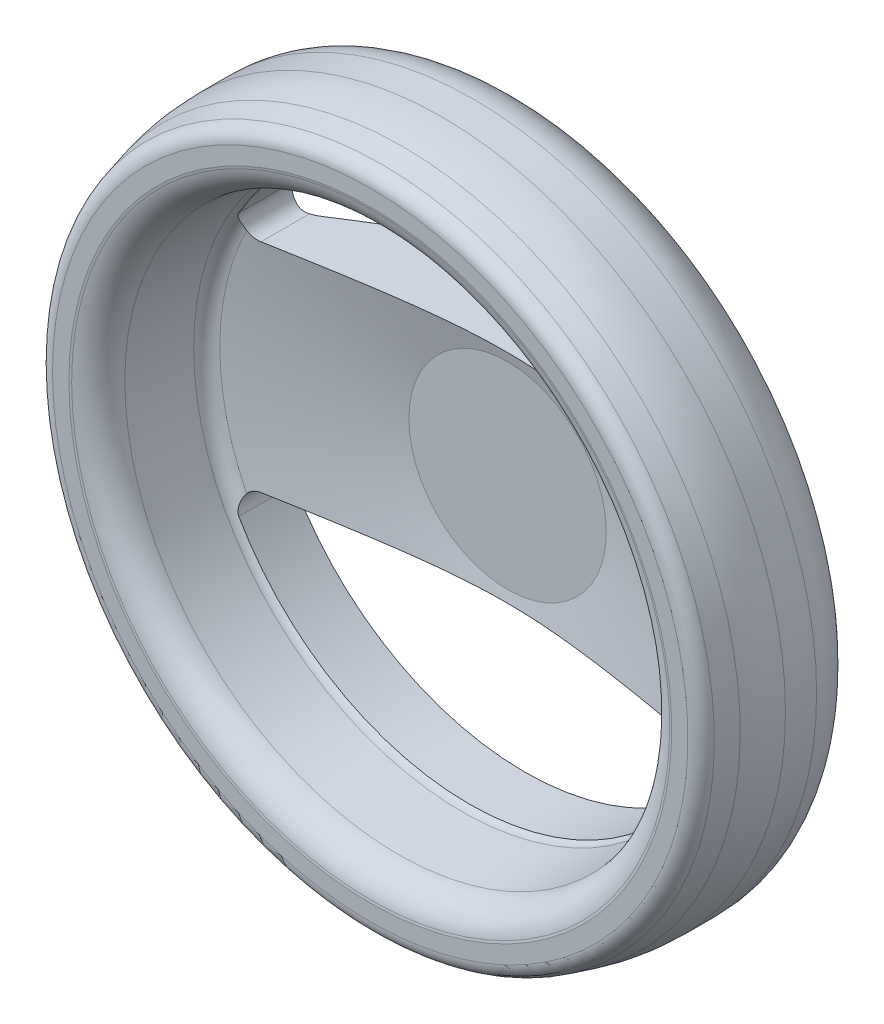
ISO-10303-21;
HEADER;
FILE_DESCRIPTION(('STEP AP214'),'2;1');
FILE_NAME('part.step','',(''),(''),'','','');
FILE_SCHEMA(('AUTOMOTIVE_DESIGN { 1 0 10303 214 1 1 1 1 }'));
ENDSEC;
DATA;
#1=APPLICATION_CONTEXT('core data for automotive mechanical design processes');
#2=APPLICATION_PROTOCOL_DEFINITION('international standard','automotive_design',2000,#1);
#3=PRODUCT_CONTEXT('',#1,'mechanical');
#4=PRODUCT('Part','Part','',(#3));
#5=PRODUCT_RELATED_PRODUCT_CATEGORY('part','',(#4));
#6=PRODUCT_DEFINITION_FORMATION('','',#4);
#7=PRODUCT_DEFINITION_CONTEXT('part definition',#1,'design');
#8=PRODUCT_DEFINITION('design','',#6,#7);
#9=PRODUCT_DEFINITION_SHAPE('','',#8);
#10=(LENGTH_UNIT() NAMED_UNIT(*) SI_UNIT(.MILLI.,.METRE.));
#11=(NAMED_UNIT(*) PLANE_ANGLE_UNIT() SI_UNIT($,.RADIAN.));
#12=(NAMED_UNIT(*) SI_UNIT($,.STERADIAN.) SOLID_ANGLE_UNIT());
#13=UNCERTAINTY_MEASURE_WITH_UNIT(LENGTH_MEASURE(1.E-05),#10,'distance_accuracy_value','');
#14=(GEOMETRIC_REPRESENTATION_CONTEXT(3) GLOBAL_UNCERTAINTY_ASSIGNED_CONTEXT((#13)) GLOBAL_UNIT_ASSIGNED_CONTEXT((#10,
#11,#12)) REPRESENTATION_CONTEXT('',''));
#15=CARTESIAN_POINT('',(0.,0.,0.));
#16=DIRECTION('',(0.,0.,1.));
#17=DIRECTION('',(1.,0.,0.));
#18=AXIS2_PLACEMENT_3D('',#15,#16,#17);
#19=CARTESIAN_POINT('',(-2.24999999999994,0.,17.));
#20=DIRECTION('',(0.,0.,-1.));
#21=DIRECTION('',(0.,1.,0.));
#22=AXIS2_PLACEMENT_3D('',#19,#20,#21);
#23=PLANE('',#22);
#24=CARTESIAN_POINT('',(0.,0.,16.9999999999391));
#25=DIRECTION('',(0.,0.,1.));
#26=DIRECTION('',(-1.,0.,0.));
#27=AXIS2_PLACEMENT_3D('',#24,#25,#26);
#28=CIRCLE('',#27,4.49999999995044);
#29=CARTESIAN_POINT('',(-4.49999999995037,0.,16.9999999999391));
#30=VERTEX_POINT('',#29);
#31=EDGE_CURVE('E596',#30,#30,#28,.F.);
#32=ORIENTED_EDGE('',*,*,#31,.T.);
#33=EDGE_LOOP('',(#32));
#34=FACE_BOUND('',#33,.T.);
#35=ADVANCED_FACE('F14',(#34),#23,.T.);
#36=CARTESIAN_POINT('',(0.,0.,16.9999999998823));
#37=DIRECTION('',(0.,0.,1.));
#38=DIRECTION('',(-1.,0.,0.));
#39=AXIS2_PLACEMENT_3D('',#36,#37,#38);
#40=CONICAL_SURFACE('',#39,4.49999999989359,0.785398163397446);
#41=ORIENTED_EDGE('',*,*,#31,.F.);
#42=EDGE_LOOP('',(#41));
#43=FACE_BOUND('',#42,.T.);
#44=CARTESIAN_POINT('',(0.,0.,16.5));
#45=DIRECTION('',(0.,0.,1.));
#46=DIRECTION('',(-1.,0.,0.));
#47=AXIS2_PLACEMENT_3D('',#44,#45,#46);
#48=CIRCLE('',#47,4.);
#49=CARTESIAN_POINT('',(-3.99999999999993,0.,16.5));
#50=VERTEX_POINT('',#49);
#51=EDGE_CURVE('E593',#50,#50,#48,.F.);
#52=ORIENTED_EDGE('',*,*,#51,.T.);
#53=EDGE_LOOP('',(#52));
#54=FACE_BOUND('',#53,.T.);
#55=ADVANCED_FACE('F729',(#43,#54),#40,.F.);
#56=CARTESIAN_POINT('',(0.,0.,8.35));
#57=DIRECTION('',(0.,0.,1.));
#58=DIRECTION('',(-1.,0.,0.));
#59=AXIS2_PLACEMENT_3D('',#56,#57,#58);
#60=CYLINDRICAL_SURFACE('',#59,4.);
#61=ORIENTED_EDGE('',*,*,#51,.F.);
#62=EDGE_LOOP('',(#61));
#63=FACE_BOUND('',#62,.T.);
#64=CARTESIAN_POINT('',(0.,0.,0.200000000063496));
#65=DIRECTION('',(0.,0.,-1.));
#66=DIRECTION('',(-1.,0.,0.));
#67=AXIS2_PLACEMENT_3D('',#64,#65,#66);
#68=CIRCLE('',#67,3.99999999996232);
#69=CARTESIAN_POINT('',(-3.99999999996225,0.,0.200000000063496));
#70=VERTEX_POINT('',#69);
#71=EDGE_CURVE('E589',#70,#70,#68,.T.);
#72=ORIENTED_EDGE('',*,*,#71,.T.);
#73=EDGE_LOOP('',(#72));
#74=FACE_BOUND('',#73,.T.);
#75=ADVANCED_FACE('F732',(#63,#74),#60,.F.);
#76=CARTESIAN_POINT('',(0.,0.,0.));
#77=DIRECTION('',(0.,0.,-1.));
#78=DIRECTION('',(1.,0.,0.));
#79=AXIS2_PLACEMENT_3D('',#76,#77,#78);
#80=CONICAL_SURFACE('',#79,4.2000000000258,0.785398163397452);
#81=ORIENTED_EDGE('',*,*,#71,.F.);
#82=EDGE_LOOP('',(#81));
#83=FACE_BOUND('',#82,.T.);
#84=CARTESIAN_POINT('',(0.,0.,0.));
#85=DIRECTION('',(0.,0.,-1.));
#86=DIRECTION('',(1.,0.,0.));
#87=AXIS2_PLACEMENT_3D('',#84,#85,#86);
#88=CIRCLE('',#87,4.20000000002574);
#89=CARTESIAN_POINT('',(4.20000000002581,0.,0.));
#90=VERTEX_POINT('',#89);
#91=EDGE_CURVE('E592',#90,#90,#88,.F.);
#92=ORIENTED_EDGE('',*,*,#91,.F.);
#93=EDGE_LOOP('',(#92));
#94=FACE_BOUND('',#93,.T.);
#95=ADVANCED_FACE('F737',(#83,#94),#80,.F.);
#96=CARTESIAN_POINT('',(-6.6,0.,0.));
#97=DIRECTION('',(0.,0.,-1.));
#98=DIRECTION('',(1.,0.,0.));
#99=AXIS2_PLACEMENT_3D('',#96,#97,#98);
#100=PLANE('',#99);
#101=CARTESIAN_POINT('',(0.,0.,0.));
#102=DIRECTION('',(0.,0.,1.));
#103=DIRECTION('',(-1.,0.,0.));
#104=AXIS2_PLACEMENT_3D('',#101,#102,#103);
#105=CIRCLE('',#104,9.);
#106=CARTESIAN_POINT('',(-8.99999999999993,0.,0.));
#107=VERTEX_POINT('',#106);
#108=EDGE_CURVE('E721',#107,#107,#105,.T.);
#109=ORIENTED_EDGE('',*,*,#108,.F.);
#110=EDGE_LOOP('',(#109));
#111=FACE_BOUND('',#110,.T.);
#112=ORIENTED_EDGE('',*,*,#91,.T.);
#113=EDGE_LOOP('',(#112));
#114=FACE_BOUND('',#113,.T.);
#115=ADVANCED_FACE('F743',(#111,#114),#100,.T.);
#116=CARTESIAN_POINT('',(0.,0.,0.100000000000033));
#117=DIRECTION('',(0.,0.,1.));
#118=DIRECTION('',(-1.,0.,0.));
#119=AXIS2_PLACEMENT_3D('',#116,#117,#118);
#120=CYLINDRICAL_SURFACE('',#119,9.);
#121=ORIENTED_EDGE('',*,*,#108,.T.);
#122=EDGE_LOOP('',(#121));
#123=FACE_BOUND('',#122,.T.);
#124=CARTESIAN_POINT('',(0.,0.,0.200000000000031));
#125=DIRECTION('',(0.,0.,1.));
#126=DIRECTION('',(-1.,0.,0.));
#127=AXIS2_PLACEMENT_3D('',#124,#125,#126);
#128=CIRCLE('',#127,9.);
#129=CARTESIAN_POINT('',(-8.99999999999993,0.,0.200000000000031));
#130=VERTEX_POINT('',#129);
#131=EDGE_CURVE('E588',#130,#130,#128,.T.);
#132=ORIENTED_EDGE('',*,*,#131,.F.);
#133=EDGE_LOOP('',(#132));
#134=FACE_BOUND('',#133,.T.);
#135=ADVANCED_FACE('F538',(#123,#134),#120,.T.);
#136=CARTESIAN_POINT('',(-10.,0.,0.200000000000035));
#137=DIRECTION('',(0.,0.,-1.));
#138=DIRECTION('',(0.,1.,0.));
#139=AXIS2_PLACEMENT_3D('',#136,#137,#138);
#140=PLANE('',#139);
#141=CARTESIAN_POINT('',(0.,0.,0.20000000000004));
#142=DIRECTION('',(0.,0.,1.));
#143=DIRECTION('',(0.,-1.,0.));
#144=AXIS2_PLACEMENT_3D('',#141,#142,#143);
#145=CIRCLE('',#144,11.);
#146=CARTESIAN_POINT('',(0.,-11.,0.200000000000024));
#147=VERTEX_POINT('',#146);
#148=CARTESIAN_POINT('',(0.,11.,0.200000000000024));
#149=VERTEX_POINT('',#148);
#150=EDGE_CURVE('E557',#147,#149,#145,.T.);
#151=ORIENTED_EDGE('',*,*,#150,.F.);
#152=CARTESIAN_POINT('',(0.,0.,0.20000000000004));
#153=DIRECTION('',(0.,0.,1.));
#154=DIRECTION('',(-1.,0.,0.));
#155=AXIS2_PLACEMENT_3D('',#152,#153,#154);
#156=CIRCLE('',#155,11.);
#157=CARTESIAN_POINT('',(-11.,0.,0.200000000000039));
#158=VERTEX_POINT('',#157);
#159=EDGE_CURVE('E566',#158,#147,#156,.T.);
#160=ORIENTED_EDGE('',*,*,#159,.F.);
#161=CARTESIAN_POINT('',(0.,0.,0.20000000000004));
#162=DIRECTION('',(0.,0.,1.));
#163=DIRECTION('',(0.,1.,0.));
#164=AXIS2_PLACEMENT_3D('',#161,#162,#163);
#165=CIRCLE('',#164,11.);
#166=EDGE_CURVE('E569',#149,#158,#165,.T.);
#167=ORIENTED_EDGE('',*,*,#166,.F.);
#168=EDGE_LOOP('',(#151,#160,#167));
#169=FACE_BOUND('',#168,.T.);
#170=ORIENTED_EDGE('',*,*,#131,.T.);
#171=EDGE_LOOP('',(#170));
#172=FACE_BOUND('',#171,.T.);
#173=ADVANCED_FACE('F533',(#169,#172),#140,.T.);
#174=CARTESIAN_POINT('',(0.,0.,35.));
#175=DIRECTION('',(0.,0.,1.));
#176=DIRECTION('',(-1.,0.,0.));
#177=AXIS2_PLACEMENT_3D('',#174,#175,#176);
#178=CONICAL_SURFACE('',#177,35.1111111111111,1.39626340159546);
#179=CARTESIAN_POINT('',(0.,0.,35.));
#180=DIRECTION('',(0.,0.,1.));
#181=DIRECTION('',(-1.,0.,0.));
#182=AXIS2_PLACEMENT_3D('',#179,#180,#181);
#183=CIRCLE('',#182,35.1111111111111);
#184=CARTESIAN_POINT('',(-35.111111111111,0.,35.));
#185=VERTEX_POINT('',#184);
#186=EDGE_CURVE('E521',#185,#185,#183,.F.);
#187=ORIENTED_EDGE('',*,*,#186,.F.);
#188=EDGE_LOOP('',(#187));
#189=FACE_BOUND('',#188,.T.);
#190=CARTESIAN_POINT('',(0.,0.,34.9513426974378));
#191=DIRECTION('',(0.,0.,-1.));
#192=DIRECTION('',(0.,1.,0.));
#193=AXIS2_PLACEMENT_3D('',#190,#191,#192);
#194=CIRCLE('',#193,34.8351618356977);
#195=CARTESIAN_POINT('',(0.,34.8351618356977,34.9513426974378));
#196=VERTEX_POINT('',#195);
#197=EDGE_CURVE('E580',#196,#196,#194,.F.);
#198=ORIENTED_EDGE('',*,*,#197,.F.);
#199=EDGE_LOOP('',(#198));
#200=FACE_BOUND('',#199,.T.);
#201=ADVANCED_FACE('F529',(#189,#200),#178,.F.);
#202=CARTESIAN_POINT('',(0.,0.,31.4060347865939));
#203=DIRECTION('',(0.,0.,-1.));
#204=DIRECTION('',(0.,1.,0.));
#205=AXIS2_PLACEMENT_3D('',#202,#203,#204);
#206=TOROIDAL_SURFACE('',#205,35.4602952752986,3.6);
#207=CARTESIAN_POINT('',(0.,0.,31.7197954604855));
#208=DIRECTION('',(0.,0.,1.));
#209=DIRECTION('',(-1.,0.,0.));
#210=AXIS2_PLACEMENT_3D('',#207,#208,#209);
#211=CIRCLE('',#210,31.8739943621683);
#212=CARTESIAN_POINT('',(-31.8739943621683,0.,31.7197954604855));
#213=VERTEX_POINT('',#212);
#214=EDGE_CURVE('E518',#213,#213,#211,.F.);
#215=ORIENTED_EDGE('',*,*,#214,.T.);
#216=EDGE_LOOP('',(#215));
#217=FACE_BOUND('',#216,.T.);
#218=ORIENTED_EDGE('',*,*,#197,.T.);
#219=EDGE_LOOP('',(#218));
#220=FACE_BOUND('',#219,.T.);
#221=ADVANCED_FACE('F526',(#217,#220),#206,.T.);
#222=CARTESIAN_POINT('',(0.,0.,0.70000000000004));
#223=DIRECTION('',(0.,0.,-1.));
#224=DIRECTION('',(0.,1.,0.));
#225=AXIS2_PLACEMENT_3D('',#222,#223,#224);
#226=TOROIDAL_SURFACE('',#225,11.,0.5);
#227=ORIENTED_EDGE('',*,*,#150,.T.);
#228=ORIENTED_EDGE('',*,*,#166,.T.);
#229=ORIENTED_EDGE('',*,*,#159,.T.);
#230=EDGE_LOOP('',(#227,#228,#229));
#231=FACE_BOUND('',#230,.T.);
#232=CARTESIAN_POINT('',(0.,0.,0.700000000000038));
#233=DIRECTION('',(0.,0.,1.));
#234=DIRECTION('',(-1.,0.,0.));
#235=AXIS2_PLACEMENT_3D('',#232,#233,#234);
#236=CIRCLE('',#235,11.5);
#237=CARTESIAN_POINT('',(-11.4999999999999,0.,0.700000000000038));
#238=VERTEX_POINT('',#237);
#239=EDGE_CURVE('E515',#238,#238,#236,.T.);
#240=ORIENTED_EDGE('',*,*,#239,.F.);
#241=EDGE_LOOP('',(#240));
#242=FACE_BOUND('',#241,.T.);
#243=ADVANCED_FACE('F472',(#231,#242),#226,.T.);
#244=CARTESIAN_POINT('',(-36.061113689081,0.,35.));
#245=DIRECTION('',(0.,0.,1.));
#246=DIRECTION('',(0.,-1.,0.));
#247=AXIS2_PLACEMENT_3D('',#244,#245,#246);
#248=PLANE('',#247);
#249=ORIENTED_EDGE('',*,*,#186,.T.);
#250=EDGE_LOOP('',(#249));
#251=FACE_BOUND('',#250,.T.);
#252=CARTESIAN_POINT('',(0.,0.,35.));
#253=DIRECTION('',(0.,0.,-1.));
#254=DIRECTION('',(0.,-1.,0.));
#255=AXIS2_PLACEMENT_3D('',#252,#253,#254);
#256=CIRCLE('',#255,37.0111162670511);
#257=CARTESIAN_POINT('',(0.,-37.0111162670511,35.));
#258=VERTEX_POINT('',#257);
#259=CARTESIAN_POINT('',(-37.011116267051,0.,35.));
#260=VERTEX_POINT('',#259);
#261=EDGE_CURVE('E505',#258,#260,#256,.T.);
#262=ORIENTED_EDGE('',*,*,#261,.F.);
#263=CARTESIAN_POINT('',(0.,0.,35.));
#264=DIRECTION('',(0.,0.,-1.));
#265=DIRECTION('',(0.,1.,0.));
#266=AXIS2_PLACEMENT_3D('',#263,#264,#265);
#267=CIRCLE('',#266,37.0111162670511);
#268=CARTESIAN_POINT('',(0.,37.0111162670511,35.));
#269=VERTEX_POINT('',#268);
#270=EDGE_CURVE('E417',#269,#258,#267,.T.);
#271=ORIENTED_EDGE('',*,*,#270,.F.);
#272=CARTESIAN_POINT('',(0.,0.,35.));
#273=DIRECTION('',(0.,0.,-1.));
#274=DIRECTION('',(-1.,0.,0.));
#275=AXIS2_PLACEMENT_3D('',#272,#273,#274);
#276=CIRCLE('',#275,37.011116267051);
#277=EDGE_CURVE('E154',#260,#269,#276,.T.);
#278=ORIENTED_EDGE('',*,*,#277,.F.);
#279=EDGE_LOOP('',(#262,#271,#278));
#280=FACE_BOUND('',#279,.T.);
#281=ADVANCED_FACE('F462',(#251,#280),#248,.T.);
#282=CARTESIAN_POINT('',(-5.74999999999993,0.,19.));
#283=DIRECTION('',(0.,0.,1.));
#284=DIRECTION('',(-1.,0.,0.));
#285=AXIS2_PLACEMENT_3D('',#282,#283,#284);
#286=PLANE('',#285);
#287=CARTESIAN_POINT('',(0.,0.,19.));
#288=DIRECTION('',(0.,0.,1.));
#289=DIRECTION('',(-1.,0.,0.));
#290=AXIS2_PLACEMENT_3D('',#287,#288,#289);
#291=CIRCLE('',#290,11.5);
#292=CARTESIAN_POINT('',(-11.4999999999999,0.,19.));
#293=VERTEX_POINT('',#292);
#294=EDGE_CURVE('E454',#293,#293,#291,.T.);
#295=ORIENTED_EDGE('',*,*,#294,.T.);
#296=EDGE_LOOP('',(#295));
#297=FACE_BOUND('',#296,.T.);
#298=ADVANCED_FACE('F471',(#297),#286,.T.);
#299=CARTESIAN_POINT('',(0.,0.,31.7197954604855));
#300=DIRECTION('',(0.,0.,1.));
#301=DIRECTION('',(-1.,0.,0.));
#302=AXIS2_PLACEMENT_3D('',#299,#300,#301);
#303=CONICAL_SURFACE('',#302,31.8739943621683,0.0872664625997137);
#304=CARTESIAN_POINT('',(0.,0.,24.3383202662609));
#305=DIRECTION('',(0.,0.,-1.));
#306=DIRECTION('',(0.,1.,0.));
#307=AXIS2_PLACEMENT_3D('',#304,#305,#306);
#308=CIRCLE('',#307,31.2281989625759);
#309=CARTESIAN_POINT('',(0.,31.2281989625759,24.3383202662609));
#310=VERTEX_POINT('',#309);
#311=EDGE_CURVE('E451',#310,#310,#308,.T.);
#312=ORIENTED_EDGE('',*,*,#311,.T.);
#313=EDGE_LOOP('',(#312));
#314=FACE_BOUND('',#313,.T.);
#315=ORIENTED_EDGE('',*,*,#214,.F.);
#316=EDGE_LOOP('',(#315));
#317=FACE_BOUND('',#316,.T.);
#318=ADVANCED_FACE('F799',(#314,#317),#303,.F.);
#319=CARTESIAN_POINT('',(0.,0.,2.72500000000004));
#320=DIRECTION('',(0.,0.,1.));
#321=DIRECTION('',(-1.,0.,0.));
#322=AXIS2_PLACEMENT_3D('',#319,#320,#321);
#323=CYLINDRICAL_SURFACE('',#322,11.5);
#324=CARTESIAN_POINT('',(0.,0.,4.75000000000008));
#325=DIRECTION('',(0.,0.,1.));
#326=DIRECTION('',(-1.,0.,0.));
#327=AXIS2_PLACEMENT_3D('',#324,#325,#326);
#328=CIRCLE('',#327,11.5);
#329=CARTESIAN_POINT('',(-11.4999999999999,0.,4.75000000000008));
#330=VERTEX_POINT('',#329);
#331=EDGE_CURVE('E447',#330,#330,#328,.T.);
#332=ORIENTED_EDGE('',*,*,#331,.F.);
#333=EDGE_LOOP('',(#332));
#334=FACE_BOUND('',#333,.T.);
#335=ORIENTED_EDGE('',*,*,#239,.T.);
#336=EDGE_LOOP('',(#335));
#337=FACE_BOUND('',#336,.T.);
#338=ADVANCED_FACE('F433',(#334,#337),#323,.T.);
#339=CARTESIAN_POINT('',(0.,0.,33.2));
#340=DIRECTION('',(0.,0.,-1.));
#341=DIRECTION('',(0.,1.,0.));
#342=AXIS2_PLACEMENT_3D('',#339,#340,#341);
#343=TOROIDAL_SURFACE('',#342,37.0111162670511,1.8);
#344=CARTESIAN_POINT('',(0.,0.,33.6658742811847));
#345=DIRECTION('',(0.,0.,-1.));
#346=DIRECTION('',(-1.,0.,0.));
#347=AXIS2_PLACEMENT_3D('',#344,#345,#346);
#348=CIRCLE('',#347,38.7497827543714);
#349=CARTESIAN_POINT('',(-38.7497827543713,0.,33.6658742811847));
#350=VERTEX_POINT('',#349);
#351=EDGE_CURVE('E235',#350,#350,#348,.T.);
#352=ORIENTED_EDGE('',*,*,#351,.F.);
#353=EDGE_LOOP('',(#352));
#354=FACE_BOUND('',#353,.T.);
#355=ORIENTED_EDGE('',*,*,#261,.T.);
#356=ORIENTED_EDGE('',*,*,#277,.T.);
#357=ORIENTED_EDGE('',*,*,#270,.T.);
#358=EDGE_LOOP('',(#355,#356,#357));
#359=FACE_BOUND('',#358,.T.);
#360=ADVANCED_FACE('F422',(#354,#359),#343,.T.);
#361=CARTESIAN_POINT('',(-25.3075607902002,-12.65,0.));
#362=DIRECTION('',(0.,1.,0.));
#363=DIRECTION('',(-1.,0.,0.));
#364=AXIS2_PLACEMENT_3D('',#361,#362,#363);
#365=PLANE('',#364);
#366=DIRECTION('',(0.,0.,-1.));
#367=VECTOR('',#366,1.);
#368=CARTESIAN_POINT('',(-25.3075607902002,-12.65,0.));
#369=LINE('',#368,#367);
#370=CARTESIAN_POINT('',(-25.3075607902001,-12.65,22.4252057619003));
#371=VERTEX_POINT('',#370);
#372=CARTESIAN_POINT('',(-25.3075607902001,-12.65,16.7813608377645));
#373=VERTEX_POINT('',#372);
#374=EDGE_CURVE('E232',#371,#373,#369,.T.);
#375=ORIENTED_EDGE('',*,*,#374,.T.);
#376=CARTESIAN_POINT('',(-24.3189645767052,-12.65,16.3123415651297));
#377=CARTESIAN_POINT('',(-24.357529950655,-12.65,16.3372021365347));
#378=CARTESIAN_POINT('',(-24.3965087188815,-12.65,16.3614204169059));
#379=CARTESIAN_POINT('',(-24.4751206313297,-12.65,16.4084861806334));
#380=CARTESIAN_POINT('',(-24.5147513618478,-12.65,16.4313376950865));
#381=CARTESIAN_POINT('',(-24.5946537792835,-12.65,16.4756932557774));
#382=CARTESIAN_POINT('',(-24.6349239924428,-12.65,16.4971999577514));
#383=CARTESIAN_POINT('',(-24.7160953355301,-12.65,16.5388841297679));
#384=CARTESIAN_POINT('',(-24.7569957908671,-12.65,16.5590629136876));
#385=CARTESIAN_POINT('',(-24.8394177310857,-12.65,16.5981030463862));
#386=CARTESIAN_POINT('',(-24.8809391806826,-12.65,16.6169644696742));
#387=CARTESIAN_POINT('',(-24.9646031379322,-12.65,16.6533803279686));
#388=CARTESIAN_POINT('',(-25.0067462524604,-12.65,16.6709333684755));
#389=CARTESIAN_POINT('',(-25.0916522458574,-12.65,16.7047358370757));
#390=CARTESIAN_POINT('',(-25.1344162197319,-12.65,16.7209825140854));
#391=CARTESIAN_POINT('',(-25.2205648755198,-12.65,16.7521707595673));
#392=CARTESIAN_POINT('',(-25.2639510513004,-12.65,16.7671082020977));
#393=CARTESIAN_POINT('',(-25.3075607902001,-12.65,16.7813608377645));
#394=B_SPLINE_CURVE_WITH_KNOTS('',3,(#376,#377,#378,#379,#380,#381,#382,#383,#384,#385,#386,
#387,#388,#389,#390,#391,#392,#393),.UNSPECIFIED.,.F.,.F.,(4,2,2,2,2,2,2,2,4),(0.,
0.137644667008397,0.274861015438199,0.411797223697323,0.548595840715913,0.685386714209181,
0.822321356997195,0.959537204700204,1.09717099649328),.UNSPECIFIED.);
#395=CARTESIAN_POINT('',(-24.3189645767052,-12.65,16.3123415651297));
#396=VERTEX_POINT('',#395);
#397=EDGE_CURVE('E153',#396,#373,#394,.T.);
#398=ORIENTED_EDGE('',*,*,#397,.F.);
#399=CARTESIAN_POINT('',(24.3189645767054,-12.65,16.3123415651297));
#400=CARTESIAN_POINT('',(23.863452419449,-12.65,16.0187246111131));
#401=CARTESIAN_POINT('',(23.4071556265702,-12.65,15.7263182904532));
#402=CARTESIAN_POINT('',(22.4927105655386,-12.65,15.1443894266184));
#403=CARTESIAN_POINT('',(22.0345622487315,-12.65,14.8548669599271));
#404=CARTESIAN_POINT('',(21.1158238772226,-12.65,14.2789757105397));
#405=CARTESIAN_POINT('',(20.6552322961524,-12.65,13.9926093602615));
#406=CARTESIAN_POINT('',(19.7316018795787,-12.65,13.4238543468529));
#407=CARTESIAN_POINT('',(19.2685630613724,-12.65,13.1414656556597));
#408=CARTESIAN_POINT('',(18.3260295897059,-12.65,12.5732109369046));
#409=CARTESIAN_POINT('',(17.8464501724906,-12.65,12.2874853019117));
#410=CARTESIAN_POINT('',(16.8837448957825,-12.65,11.7220723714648));
#411=CARTESIAN_POINT('',(16.4006190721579,-12.65,11.4423850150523));
#412=CARTESIAN_POINT('',(15.4303010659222,-12.65,10.8904341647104));
#413=CARTESIAN_POINT('',(14.9431099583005,-12.65,10.6181687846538));
#414=CARTESIAN_POINT('',(13.9637785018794,-12.65,10.0826829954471));
#415=CARTESIAN_POINT('',(13.4716382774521,-12.65,9.81946235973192));
#416=CARTESIAN_POINT('',(12.6152852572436,-12.65,9.37389884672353));
#417=CARTESIAN_POINT('',(12.2524435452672,-12.65,9.1889230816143));
#418=CARTESIAN_POINT('',(11.523235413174,-12.65,8.82606368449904));
#419=CARTESIAN_POINT('',(11.1568691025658,-12.65,8.64817983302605));
#420=CARTESIAN_POINT('',(10.4200037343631,-12.65,8.30073816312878));
#421=CARTESIAN_POINT('',(10.0495029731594,-12.65,8.13118394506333));
#422=CARTESIAN_POINT('',(9.30407295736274,-12.65,7.80208701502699));
#423=CARTESIAN_POINT('',(8.92914373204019,-12.65,7.64254423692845));
#424=CARTESIAN_POINT('',(8.17790997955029,-12.65,7.33682860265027));
#425=CARTESIAN_POINT('',(7.8016510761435,-12.65,7.19054470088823));
#426=CARTESIAN_POINT('',(7.04403773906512,-12.65,6.91193412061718));
#427=CARTESIAN_POINT('',(6.66268309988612,-12.65,6.77960800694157));
#428=CARTESIAN_POINT('',(5.51093571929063,-12.65,6.4075686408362));
#429=CARTESIAN_POINT('',(4.73206319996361,-12.65,6.19245909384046));
#430=CARTESIAN_POINT('',(3.67458847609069,-12.65,5.96374685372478));
#431=CARTESIAN_POINT('',(3.40427639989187,-12.65,5.9107253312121));
#432=CARTESIAN_POINT('',(2.86170065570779,-12.65,5.81594957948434));
#433=CARTESIAN_POINT('',(2.58943732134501,-12.65,5.77419346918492));
#434=CARTESIAN_POINT('',(2.04336643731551,-12.65,5.70272404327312));
#435=CARTESIAN_POINT('',(1.7695590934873,-12.65,5.67300915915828));
#436=CARTESIAN_POINT('',(1.22085811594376,-12.65,5.62620982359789));
#437=CARTESIAN_POINT('',(0.945964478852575,-12.65,5.60912541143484));
#438=CARTESIAN_POINT('',(0.396221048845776,-12.65,5.58797232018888));
#439=CARTESIAN_POINT('',(0.121372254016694,-12.65,5.58387784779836));
#440=CARTESIAN_POINT('',(-0.428207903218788,-12.65,5.58872055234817));
#441=CARTESIAN_POINT('',(-0.70293926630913,-12.65,5.59765765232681));
#442=CARTESIAN_POINT('',(-1.25171737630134,-12.65,5.62837315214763));
#443=CARTESIAN_POINT('',(-1.52576402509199,-12.65,5.6501532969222));
#444=CARTESIAN_POINT('',(-2.07258621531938,-12.65,5.70610060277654));
#445=CARTESIAN_POINT('',(-2.34536171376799,-12.65,5.74026817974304));
#446=CARTESIAN_POINT('',(-2.97881968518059,-12.65,5.83352954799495));
#447=CARTESIAN_POINT('',(-3.33884286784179,-12.65,5.89712718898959));
#448=CARTESIAN_POINT('',(-4.05510448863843,-12.65,6.04311722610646));
#449=CARTESIAN_POINT('',(-4.4113419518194,-12.65,6.12551434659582));
#450=CARTESIAN_POINT('',(-5.11991364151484,-12.65,6.30701926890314));
#451=CARTESIAN_POINT('',(-5.47224324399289,-12.65,6.40614499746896));
#452=CARTESIAN_POINT('',(-6.17245362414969,-12.65,6.61887219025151));
#453=CARTESIAN_POINT('',(-6.5203346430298,-12.65,6.73247286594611));
#454=CARTESIAN_POINT('',(-7.21658637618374,-12.65,6.9738109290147));
#455=CARTESIAN_POINT('',(-7.56489597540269,-12.65,7.10172371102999));
#456=CARTESIAN_POINT('',(-8.25728504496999,-12.65,7.36848869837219));
#457=CARTESIAN_POINT('',(-8.60136446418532,-12.65,7.50734103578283));
#458=CARTESIAN_POINT('',(-9.28544811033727,-12.65,7.79429632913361));
#459=CARTESIAN_POINT('',(-9.62545409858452,-12.65,7.94239510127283));
#460=CARTESIAN_POINT('',(-10.3019025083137,-12.65,8.2465342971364));
#461=CARTESIAN_POINT('',(-10.6383447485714,-12.65,8.40257512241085));
#462=CARTESIAN_POINT('',(-11.5679455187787,-12.65,8.84517518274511));
#463=CARTESIAN_POINT('',(-12.1576364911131,-12.65,9.13901818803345));
#464=CARTESIAN_POINT('',(-13.3286528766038,-12.65,9.74290252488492));
#465=CARTESIAN_POINT('',(-13.9099776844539,-12.65,10.0529450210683));
#466=CARTESIAN_POINT('',(-14.7769843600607,-12.65,10.5275081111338));
#467=CARTESIAN_POINT('',(-15.0652509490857,-12.65,10.6873334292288));
#468=CARTESIAN_POINT('',(-15.6402073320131,-12.65,11.0097621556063));
#469=CARTESIAN_POINT('',(-15.9268972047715,-12.65,11.1723654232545));
#470=CARTESIAN_POINT('',(-16.7848558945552,-12.65,11.6638677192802));
#471=CARTESIAN_POINT('',(-17.3540113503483,-12.65,11.9964579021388));
#472=CARTESIAN_POINT('',(-18.4612577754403,-12.65,12.6537608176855));
#473=CARTESIAN_POINT('',(-18.9995603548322,-12.65,12.9781183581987));
#474=CARTESIAN_POINT('',(-20.0726372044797,-12.65,13.6326193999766));
#475=CARTESIAN_POINT('',(-20.6074114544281,-12.65,13.9627629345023));
#476=CARTESIAN_POINT('',(-21.6730902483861,-12.65,14.6272375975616));
#477=CARTESIAN_POINT('',(-22.2039998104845,-12.65,14.9615606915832));
#478=CARTESIAN_POINT('',(-23.2632755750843,-12.65,15.6341675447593));
#479=CARTESIAN_POINT('',(-23.7916418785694,-12.65,15.9724511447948));
#480=CARTESIAN_POINT('',(-24.3189645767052,-12.65,16.3123415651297));
#481=B_SPLINE_CURVE_WITH_KNOTS('',3,(#399,#400,#401,#402,#403,#404,#405,#406,#407,#408,#409,
#410,#411,#412,#413,#414,#415,#416,#417,#418,#419,#420,#421,#422,#423,#424,#425,#426,#427,#428,
#429,#430,#431,#432,#433,#434,#435,#436,#437,#438,#439,#440,#441,#442,#443,#444,#445,#446,#447,
#448,#449,#450,#451,#452,#453,#454,#455,#456,#457,#458,#459,#460,#461,#462,#463,#464,#465,#466,
#467,#468,#469,#470,#471,#472,#473,#474,#475,#476,#477,#478,#479,#480),.UNSPECIFIED.,.F.,.F.,(4,
2,2,2,2,2,2,2,2,2,2,2,2,2,2,2,2,2,2,2,2,2,2,2,2,2,2,2,2,2,2,2,2,2,2,2,2,2,2,2,4),(0.,
1.62583250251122,3.25170801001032,4.87875946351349,6.50579943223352,8.18049307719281,
9.85516980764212,11.5294169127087,13.2036220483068,14.4253734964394,15.6470871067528,
16.8693242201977,18.0915532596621,19.3023562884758,20.5132082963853,22.9323262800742,
23.7585394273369,24.5846145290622,25.4105819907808,26.2365520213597,27.060880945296,
27.8852050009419,28.7096410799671,29.5341048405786,30.6303131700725,31.7267972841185,
32.824463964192,33.9220708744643,35.0350188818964,36.147980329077,37.2604417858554,
38.3729595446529,40.3491344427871,42.3254516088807,43.3142640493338,44.3030265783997,
46.2805599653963,48.1659367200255,50.0513243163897,51.9335204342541,53.8156411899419),.UNSPECIFIED.);
#482=CARTESIAN_POINT('',(24.3189645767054,-12.65,16.3123415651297));
#483=VERTEX_POINT('',#482);
#484=EDGE_CURVE('E149',#483,#396,#481,.T.);
#485=ORIENTED_EDGE('',*,*,#484,.F.);
#486=CARTESIAN_POINT('',(25.3075607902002,-12.65,16.7813608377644));
#487=CARTESIAN_POINT('',(25.2639510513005,-12.65,16.7671082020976));
#488=CARTESIAN_POINT('',(25.2205648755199,-12.65,16.7521707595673));
#489=CARTESIAN_POINT('',(25.134416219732,-12.65,16.7209825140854));
#490=CARTESIAN_POINT('',(25.0916522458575,-12.65,16.7047358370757));
#491=CARTESIAN_POINT('',(25.0067462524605,-12.65,16.6709333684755));
#492=CARTESIAN_POINT('',(24.9646031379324,-12.65,16.6533803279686));
#493=CARTESIAN_POINT('',(24.8809391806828,-12.65,16.6169644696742));
#494=CARTESIAN_POINT('',(24.8394177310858,-12.65,16.5981030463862));
#495=CARTESIAN_POINT('',(24.7569957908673,-12.65,16.5590629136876));
#496=CARTESIAN_POINT('',(24.7160953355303,-12.65,16.5388841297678));
#497=CARTESIAN_POINT('',(24.6349239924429,-12.65,16.4971999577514));
#498=CARTESIAN_POINT('',(24.5946537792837,-12.65,16.4756932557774));
#499=CARTESIAN_POINT('',(24.5147513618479,-12.65,16.4313376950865));
#500=CARTESIAN_POINT('',(24.4751206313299,-12.65,16.4084861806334));
#501=CARTESIAN_POINT('',(24.3965087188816,-12.65,16.3614204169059));
#502=CARTESIAN_POINT('',(24.3575299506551,-12.65,16.3372021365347));
#503=CARTESIAN_POINT('',(24.3189645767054,-12.65,16.3123415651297));
#504=B_SPLINE_CURVE_WITH_KNOTS('',3,(#486,#487,#488,#489,#490,#491,#492,#493,#494,#495,#496,
#497,#498,#499,#500,#501,#502,#503),.UNSPECIFIED.,.F.,.F.,(4,2,2,2,2,2,2,2,4),(0.,
0.137633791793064,0.274849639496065,0.411784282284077,0.548575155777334,0.685373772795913,
0.822309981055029,0.959526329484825,1.09717099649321),.UNSPECIFIED.);
#505=CARTESIAN_POINT('',(25.3075607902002,-12.65,16.7813608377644));
#506=VERTEX_POINT('',#505);
#507=EDGE_CURVE('E141',#506,#483,#504,.T.);
#508=ORIENTED_EDGE('',*,*,#507,.F.);
#509=DIRECTION('',(0.,0.,-1.));
#510=VECTOR('',#509,1.);
#511=CARTESIAN_POINT('',(25.3075607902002,-12.65,0.));
#512=LINE('',#511,#510);
#513=CARTESIAN_POINT('',(25.3075607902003,-12.65,22.4252057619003));
#514=VERTEX_POINT('',#513);
#515=EDGE_CURVE('E145',#506,#514,#512,.F.);
#516=ORIENTED_EDGE('',*,*,#515,.T.);
#517=CARTESIAN_POINT('',(25.3075607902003,-12.65,22.4252057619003));
#518=CARTESIAN_POINT('',(24.7162178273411,-12.65,22.3173315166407));
#519=CARTESIAN_POINT('',(24.1247446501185,-12.65,22.2101653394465));
#520=CARTESIAN_POINT('',(22.9414807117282,-12.65,21.9975788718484));
#521=CARTESIAN_POINT('',(22.3496899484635,-12.65,21.8921585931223));
#522=CARTESIAN_POINT('',(21.165717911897,-12.65,21.6833909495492));
#523=CARTESIAN_POINT('',(20.5735366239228,-12.65,21.5800436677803));
#524=CARTESIAN_POINT('',(19.3887408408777,-12.65,21.3758637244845));
#525=CARTESIAN_POINT('',(18.7961263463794,-12.65,21.2750310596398));
#526=CARTESIAN_POINT('',(17.6061676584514,-12.65,21.0757205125));
#527=CARTESIAN_POINT('',(17.0088197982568,-12.65,20.9772644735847));
#528=CARTESIAN_POINT('',(15.8135081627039,-12.65,20.7841679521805));
#529=CARTESIAN_POINT('',(15.2155443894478,-12.65,20.6895274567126));
#530=CARTESIAN_POINT('',(14.0188311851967,-12.65,20.5049577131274));
#531=CARTESIAN_POINT('',(13.420081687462,-12.65,20.4150288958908));
#532=CARTESIAN_POINT('',(12.2217277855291,-12.65,20.2410388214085));
#533=CARTESIAN_POINT('',(11.6221233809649,-12.65,20.1569775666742));
#534=CARTESIAN_POINT('',(10.4328170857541,-12.65,19.9976227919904));
#535=CARTESIAN_POINT('',(9.84313302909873,-12.65,19.9221978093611));
#536=CARTESIAN_POINT('',(8.66272841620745,-12.65,19.78005429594));
#537=CARTESIAN_POINT('',(8.07200785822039,-12.65,19.7133357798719));
#538=CARTESIAN_POINT('',(6.29828080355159,-12.65,19.5292029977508));
#539=CARTESIAN_POINT('',(5.1134728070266,-12.65,19.4277783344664));
#540=CARTESIAN_POINT('',(3.33556101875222,-12.65,19.3202599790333));
#541=CARTESIAN_POINT('',(2.74378558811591,-12.65,19.2918672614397));
#542=CARTESIAN_POINT('',(1.55966496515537,-12.65,19.2513741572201));
#543=CARTESIAN_POINT('',(0.967319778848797,-12.65,19.2392736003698));
#544=CARTESIAN_POINT('',(-0.217452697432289,-12.65,19.2321143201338));
#545=CARTESIAN_POINT('',(-0.809879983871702,-12.65,19.2370550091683));
#546=CARTESIAN_POINT('',(-1.9943547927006,-12.65,19.2636683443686));
#547=CARTESIAN_POINT('',(-2.58640231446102,-12.65,19.2853410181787));
#548=CARTESIAN_POINT('',(-3.63954397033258,-12.65,19.3376721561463));
#549=CARTESIAN_POINT('',(-4.10079307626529,-12.65,19.3653048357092));
#550=CARTESIAN_POINT('',(-5.02270584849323,-12.65,19.4290942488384));
#551=CARTESIAN_POINT('',(-5.48336950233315,-12.65,19.4652511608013));
#552=CARTESIAN_POINT('',(-6.86439507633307,-12.65,19.5850306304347));
#553=CARTESIAN_POINT('',(-7.78377867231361,-12.65,19.6799612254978));
#554=CARTESIAN_POINT('',(-9.62238554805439,-12.65,19.8924853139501));
#555=CARTESIAN_POINT('',(-10.5416015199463,-12.65,20.0101400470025));
#556=CARTESIAN_POINT('',(-12.3777643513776,-12.65,20.2615863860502));
#557=CARTESIAN_POINT('',(-13.2947112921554,-12.65,20.3953774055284));
#558=CARTESIAN_POINT('',(-15.1402962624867,-12.65,20.6765542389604));
#559=CARTESIAN_POINT('',(-16.0689079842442,-12.65,20.8241110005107));
#560=CARTESIAN_POINT('',(-17.9247374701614,-12.65,21.1277720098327));
#561=CARTESIAN_POINT('',(-18.8519552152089,-12.65,21.2838763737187));
#562=CARTESIAN_POINT('',(-20.7010567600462,-12.65,21.6016052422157));
#563=CARTESIAN_POINT('',(-21.6229455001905,-12.65,21.7632011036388));
#564=CARTESIAN_POINT('',(-23.0051356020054,-12.65,22.0090649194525));
#565=CARTESIAN_POINT('',(-23.4657472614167,-12.65,22.0915958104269));
#566=CARTESIAN_POINT('',(-24.3867861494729,-12.65,22.2576738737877));
#567=CARTESIAN_POINT('',(-24.8472133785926,-12.65,22.3412210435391));
#568=CARTESIAN_POINT('',(-25.3075607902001,-12.65,22.4252057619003));
#569=B_SPLINE_CURVE_WITH_KNOTS('',3,(#517,#518,#519,#520,#521,#522,#523,#524,#525,#526,#527,
#528,#529,#530,#531,#532,#533,#534,#535,#536,#537,#538,#539,#540,#541,#542,#543,#544,#545,#546,
#547,#548,#549,#550,#551,#552,#553,#554,#555,#556,#557,#558,#559,#560,#561,#562,#563,#564,#565,
#566,#567,#568),.UNSPECIFIED.,.F.,.F.,(4,2,2,2,2,2,2,2,2,2,2,2,2,2,2,2,2,2,2,2,2,2,2,2,2,4),(0.,
1.80330645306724,3.60662496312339,5.41001559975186,7.21340385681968,9.0296159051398,
10.84582177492,12.6621934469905,14.4785658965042,16.2619648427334,18.0453668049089,
21.611455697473,23.3886363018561,25.1657983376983,26.9428990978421,28.7200027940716,
30.1061481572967,31.4923225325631,34.2647101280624,37.0446760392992,39.8245409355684,
42.6452741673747,45.4660457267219,48.2738630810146,49.6777034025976,51.0815400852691),.UNSPECIFIED.);
#570=EDGE_CURVE('E680',#514,#371,#569,.T.);
#571=ORIENTED_EDGE('',*,*,#570,.T.);
#572=EDGE_LOOP('',(#375,#398,#485,#508,#516,#571));
#573=FACE_BOUND('',#572,.T.);
#574=ADVANCED_FACE('F144',(#573),#365,.F.);
#575=CARTESIAN_POINT('',(25.3075607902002,12.65,0.));
#576=DIRECTION('',(0.,-1.,0.));
#577=DIRECTION('',(1.,0.,0.));
#578=AXIS2_PLACEMENT_3D('',#575,#576,#577);
#579=PLANE('',#578);
#580=DIRECTION('',(0.,0.,-1.));
#581=VECTOR('',#580,1.);
#582=CARTESIAN_POINT('',(25.3075607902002,12.65,0.));
#583=LINE('',#582,#581);
#584=CARTESIAN_POINT('',(25.3075607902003,12.65,22.4252057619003));
#585=VERTEX_POINT('',#584);
#586=CARTESIAN_POINT('',(25.3075607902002,12.65,16.7813608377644));
#587=VERTEX_POINT('',#586);
#588=EDGE_CURVE('E212',#585,#587,#583,.T.);
#589=ORIENTED_EDGE('',*,*,#588,.T.);
#590=CARTESIAN_POINT('',(25.3075607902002,12.65,16.7813608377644));
#591=CARTESIAN_POINT('',(25.2639510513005,12.65,16.7671082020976));
#592=CARTESIAN_POINT('',(25.2205648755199,12.65,16.7521707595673));
#593=CARTESIAN_POINT('',(25.134416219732,12.65,16.7209825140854));
#594=CARTESIAN_POINT('',(25.0916522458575,12.65,16.7047358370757));
#595=CARTESIAN_POINT('',(25.0067462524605,12.65,16.6709333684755));
#596=CARTESIAN_POINT('',(24.9646031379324,12.65,16.6533803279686));
#597=CARTESIAN_POINT('',(24.8809391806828,12.65,16.6169644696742));
#598=CARTESIAN_POINT('',(24.8394177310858,12.65,16.5981030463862));
#599=CARTESIAN_POINT('',(24.7569957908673,12.65,16.5590629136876));
#600=CARTESIAN_POINT('',(24.7160953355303,12.65,16.5388841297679));
#601=CARTESIAN_POINT('',(24.6349239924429,12.65,16.4971999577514));
#602=CARTESIAN_POINT('',(24.5946537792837,12.65,16.4756932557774));
#603=CARTESIAN_POINT('',(24.5147513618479,12.65,16.4313376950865));
#604=CARTESIAN_POINT('',(24.4751206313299,12.65,16.4084861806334));
#605=CARTESIAN_POINT('',(24.3965087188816,12.65,16.3614204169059));
#606=CARTESIAN_POINT('',(24.3575299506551,12.65,16.3372021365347));
#607=CARTESIAN_POINT('',(24.3189645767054,12.65,16.3123415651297));
#608=B_SPLINE_CURVE_WITH_KNOTS('',3,(#590,#591,#592,#593,#594,#595,#596,#597,#598,#599,#600,
#601,#602,#603,#604,#605,#606,#607),.UNSPECIFIED.,.F.,.F.,(4,2,2,2,2,2,2,2,4),(0.,
0.137633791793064,0.274849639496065,0.411784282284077,0.548575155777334,0.685373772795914,
0.822309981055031,0.959526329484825,1.09717099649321),.UNSPECIFIED.);
#609=CARTESIAN_POINT('',(24.3189645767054,12.65,16.3123415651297));
#610=VERTEX_POINT('',#609);
#611=EDGE_CURVE('E172',#587,#610,#608,.T.);
#612=ORIENTED_EDGE('',*,*,#611,.T.);
#613=CARTESIAN_POINT('',(-24.3189645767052,12.65,16.3123415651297));
#614=CARTESIAN_POINT('',(-23.8634524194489,12.65,16.0187246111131));
#615=CARTESIAN_POINT('',(-23.4071556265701,12.65,15.7263182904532));
#616=CARTESIAN_POINT('',(-22.4927105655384,12.65,15.1443894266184));
#617=CARTESIAN_POINT('',(-22.0345622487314,12.65,14.8548669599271));
#618=CARTESIAN_POINT('',(-21.1158238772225,12.65,14.2789757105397));
#619=CARTESIAN_POINT('',(-20.6552322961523,12.65,13.9926093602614));
#620=CARTESIAN_POINT('',(-19.7316018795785,12.65,13.4238543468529));
#621=CARTESIAN_POINT('',(-19.2685630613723,12.65,13.1414656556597));
#622=CARTESIAN_POINT('',(-18.3260295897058,12.65,12.5732109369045));
#623=CARTESIAN_POINT('',(-17.8464501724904,12.65,12.2874853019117));
#624=CARTESIAN_POINT('',(-16.8837448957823,12.65,11.7220723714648));
#625=CARTESIAN_POINT('',(-16.4006190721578,12.65,11.4423850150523));
#626=CARTESIAN_POINT('',(-15.4303010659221,12.65,10.8904341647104));
#627=CARTESIAN_POINT('',(-14.9431099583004,12.65,10.6181687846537));
#628=CARTESIAN_POINT('',(-13.9637785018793,12.65,10.0826829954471));
#629=CARTESIAN_POINT('',(-13.4716382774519,12.65,9.81946235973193));
#630=CARTESIAN_POINT('',(-12.6152852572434,12.65,9.37389884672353));
#631=CARTESIAN_POINT('',(-12.2524435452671,12.65,9.18892308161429));
#632=CARTESIAN_POINT('',(-11.5232354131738,12.65,8.82606368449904));
#633=CARTESIAN_POINT('',(-11.1568691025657,12.65,8.64817983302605));
#634=CARTESIAN_POINT('',(-10.420003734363,12.65,8.30073816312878));
#635=CARTESIAN_POINT('',(-10.0495029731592,12.65,8.13118394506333));
#636=CARTESIAN_POINT('',(-9.3040729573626,12.65,7.80208701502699));
#637=CARTESIAN_POINT('',(-8.92914373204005,12.65,7.64254423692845));
#638=CARTESIAN_POINT('',(-8.17790997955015,12.65,7.33682860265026));
#639=CARTESIAN_POINT('',(-7.80165107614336,12.65,7.19054470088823));
#640=CARTESIAN_POINT('',(-7.04403773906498,12.65,6.91193412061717));
#641=CARTESIAN_POINT('',(-6.66268309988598,12.65,6.77960800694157));
#642=CARTESIAN_POINT('',(-5.51093571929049,12.65,6.40756864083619));
#643=CARTESIAN_POINT('',(-4.73206319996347,12.65,6.19245909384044));
#644=CARTESIAN_POINT('',(-3.67458847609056,12.65,5.96374685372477));
#645=CARTESIAN_POINT('',(-3.40427639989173,12.65,5.9107253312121));
#646=CARTESIAN_POINT('',(-2.86170065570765,12.65,5.81594957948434));
#647=CARTESIAN_POINT('',(-2.58943732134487,12.65,5.77419346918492));
#648=CARTESIAN_POINT('',(-2.04336643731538,12.65,5.70272404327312));
#649=CARTESIAN_POINT('',(-1.76955909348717,12.65,5.67300915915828));
#650=CARTESIAN_POINT('',(-1.22085811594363,12.65,5.62620982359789));
#651=CARTESIAN_POINT('',(-0.945964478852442,12.65,5.60912541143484));
#652=CARTESIAN_POINT('',(-0.396221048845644,12.65,5.58797232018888));
#653=CARTESIAN_POINT('',(-0.121372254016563,12.65,5.58387784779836));
#654=CARTESIAN_POINT('',(0.42820790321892,12.65,5.58872055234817));
#655=CARTESIAN_POINT('',(0.702939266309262,12.65,5.59765765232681));
#656=CARTESIAN_POINT('',(1.25171737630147,12.65,5.62837315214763));
#657=CARTESIAN_POINT('',(1.52576402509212,12.65,5.6501532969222));
#658=CARTESIAN_POINT('',(2.07258621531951,12.65,5.70610060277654));
#659=CARTESIAN_POINT('',(2.34536171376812,12.65,5.74026817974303));
#660=CARTESIAN_POINT('',(2.97881968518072,12.65,5.83352954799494));
#661=CARTESIAN_POINT('',(3.33884286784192,12.65,5.89712718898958));
#662=CARTESIAN_POINT('',(4.05510448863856,12.65,6.04311722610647));
#663=CARTESIAN_POINT('',(4.41134195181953,12.65,6.12551434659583));
#664=CARTESIAN_POINT('',(5.11991364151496,12.65,6.30701926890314));
#665=CARTESIAN_POINT('',(5.47224324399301,12.65,6.40614499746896));
#666=CARTESIAN_POINT('',(6.17245362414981,12.65,6.61887219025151));
#667=CARTESIAN_POINT('',(6.52033464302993,12.65,6.73247286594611));
#668=CARTESIAN_POINT('',(7.21658637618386,12.65,6.9738109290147));
#669=CARTESIAN_POINT('',(7.56489597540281,12.65,7.10172371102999));
#670=CARTESIAN_POINT('',(8.25728504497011,12.65,7.36848869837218));
#671=CARTESIAN_POINT('',(8.60136446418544,12.65,7.50734103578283));
#672=CARTESIAN_POINT('',(9.28544811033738,12.65,7.79429632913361));
#673=CARTESIAN_POINT('',(9.62545409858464,12.65,7.94239510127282));
#674=CARTESIAN_POINT('',(10.3019025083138,12.65,8.24653429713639));
#675=CARTESIAN_POINT('',(10.6383447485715,12.65,8.40257512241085));
#676=CARTESIAN_POINT('',(11.5679455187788,12.65,8.84517518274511));
#677=CARTESIAN_POINT('',(12.1576364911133,12.65,9.13901818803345));
#678=CARTESIAN_POINT('',(13.3286528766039,12.65,9.74290252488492));
#679=CARTESIAN_POINT('',(13.9099776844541,12.65,10.0529450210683));
#680=CARTESIAN_POINT('',(14.7769843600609,12.65,10.5275081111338));
#681=CARTESIAN_POINT('',(15.0652509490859,12.65,10.6873334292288));
#682=CARTESIAN_POINT('',(15.6402073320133,12.65,11.0097621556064));
#683=CARTESIAN_POINT('',(15.9268972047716,12.65,11.1723654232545));
#684=CARTESIAN_POINT('',(16.7848558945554,12.65,11.6638677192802));
#685=CARTESIAN_POINT('',(17.3540113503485,12.65,11.9964579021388));
#686=CARTESIAN_POINT('',(18.4612577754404,12.65,12.6537608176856));
#687=CARTESIAN_POINT('',(18.9995603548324,12.65,12.9781183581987));
#688=CARTESIAN_POINT('',(20.0726372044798,12.65,13.6326193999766));
#689=CARTESIAN_POINT('',(20.6074114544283,12.65,13.9627629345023));
#690=CARTESIAN_POINT('',(21.6730902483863,12.65,14.6272375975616));
#691=CARTESIAN_POINT('',(22.2039998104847,12.65,14.9615606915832));
#692=CARTESIAN_POINT('',(23.2632755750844,12.65,15.6341675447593));
#693=CARTESIAN_POINT('',(23.7916418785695,12.65,15.9724511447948));
#694=CARTESIAN_POINT('',(24.3189645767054,12.65,16.3123415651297));
#695=B_SPLINE_CURVE_WITH_KNOTS('',3,(#613,#614,#615,#616,#617,#618,#619,#620,#621,#622,#623,
#624,#625,#626,#627,#628,#629,#630,#631,#632,#633,#634,#635,#636,#637,#638,#639,#640,#641,#642,
#643,#644,#645,#646,#647,#648,#649,#650,#651,#652,#653,#654,#655,#656,#657,#658,#659,#660,#661,
#662,#663,#664,#665,#666,#667,#668,#669,#670,#671,#672,#673,#674,#675,#676,#677,#678,#679,#680,
#681,#682,#683,#684,#685,#686,#687,#688,#689,#690,#691,#692,#693,#694),.UNSPECIFIED.,.F.,.F.,(4,
2,2,2,2,2,2,2,2,2,2,2,2,2,2,2,2,2,2,2,2,2,2,2,2,2,2,2,2,2,2,2,2,2,2,2,2,2,2,2,4),(0.,
1.62583250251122,3.25170801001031,4.87875946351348,6.50579943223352,8.1804930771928,
9.85516980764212,11.5294169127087,13.2036220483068,14.4253734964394,15.6470871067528,
16.8693242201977,18.0915532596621,19.3023562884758,20.5132082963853,22.9323262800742,
23.7585394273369,24.5846145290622,25.4105819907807,26.2365520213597,27.0608809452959,
27.8852050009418,28.7096410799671,29.5341048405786,30.6303131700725,31.7267972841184,
32.8244639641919,33.9220708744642,35.0350188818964,36.147980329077,37.2604417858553,
38.3729595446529,40.3491344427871,42.3254516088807,43.3142640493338,44.3030265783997,
46.2805599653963,48.1659367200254,50.0513243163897,51.933520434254,53.8156411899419),.UNSPECIFIED.);
#696=CARTESIAN_POINT('',(-24.3189645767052,12.65,16.3123415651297));
#697=VERTEX_POINT('',#696);
#698=EDGE_CURVE('E450',#697,#610,#695,.T.);
#699=ORIENTED_EDGE('',*,*,#698,.F.);
#700=CARTESIAN_POINT('',(-25.3075607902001,12.65,16.7813608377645));
#701=CARTESIAN_POINT('',(-25.2639510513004,12.65,16.7671082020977));
#702=CARTESIAN_POINT('',(-25.2205648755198,12.65,16.7521707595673));
#703=CARTESIAN_POINT('',(-25.1344162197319,12.65,16.7209825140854));
#704=CARTESIAN_POINT('',(-25.0916522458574,12.65,16.7047358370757));
#705=CARTESIAN_POINT('',(-25.0067462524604,12.65,16.6709333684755));
#706=CARTESIAN_POINT('',(-24.9646031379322,12.65,16.6533803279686));
#707=CARTESIAN_POINT('',(-24.8809391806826,12.65,16.6169644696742));
#708=CARTESIAN_POINT('',(-24.8394177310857,12.65,16.5981030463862));
#709=CARTESIAN_POINT('',(-24.7569957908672,12.65,16.5590629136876));
#710=CARTESIAN_POINT('',(-24.7160953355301,12.65,16.5388841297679));
#711=CARTESIAN_POINT('',(-24.6349239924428,12.65,16.4971999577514));
#712=CARTESIAN_POINT('',(-24.5946537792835,12.65,16.4756932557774));
#713=CARTESIAN_POINT('',(-24.5147513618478,12.65,16.4313376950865));
#714=CARTESIAN_POINT('',(-24.4751206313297,12.65,16.4084861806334));
#715=CARTESIAN_POINT('',(-24.3965087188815,12.65,16.3614204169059));
#716=CARTESIAN_POINT('',(-24.3575299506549,12.65,16.3372021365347));
#717=CARTESIAN_POINT('',(-24.3189645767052,12.65,16.3123415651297));
#718=B_SPLINE_CURVE_WITH_KNOTS('',3,(#700,#701,#702,#703,#704,#705,#706,#707,#708,#709,#710,
#711,#712,#713,#714,#715,#716,#717),.UNSPECIFIED.,.F.,.F.,(4,2,2,2,2,2,2,2,4),(0.,
0.137633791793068,0.274849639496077,0.411784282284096,0.548575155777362,0.685373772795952,
0.822309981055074,0.959526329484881,1.09717099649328),.UNSPECIFIED.);
#719=CARTESIAN_POINT('',(-25.3075607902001,12.65,16.7813608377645));
#720=VERTEX_POINT('',#719);
#721=EDGE_CURVE('E702',#720,#697,#718,.T.);
#722=ORIENTED_EDGE('',*,*,#721,.F.);
#723=DIRECTION('',(0.,0.,-1.));
#724=VECTOR('',#723,1.);
#725=CARTESIAN_POINT('',(-25.3075607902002,12.65,0.));
#726=LINE('',#725,#724);
#727=CARTESIAN_POINT('',(-25.3075607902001,12.65,22.4252057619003));
#728=VERTEX_POINT('',#727);
#729=EDGE_CURVE('E651',#720,#728,#726,.F.);
#730=ORIENTED_EDGE('',*,*,#729,.T.);
#731=CARTESIAN_POINT('',(-25.3075607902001,12.65,22.4252057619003));
#732=CARTESIAN_POINT('',(-24.7162178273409,12.65,22.3173315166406));
#733=CARTESIAN_POINT('',(-24.1247446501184,12.65,22.2101653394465));
#734=CARTESIAN_POINT('',(-22.9414807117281,12.65,21.9975788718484));
#735=CARTESIAN_POINT('',(-22.3496899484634,12.65,21.8921585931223));
#736=CARTESIAN_POINT('',(-21.1657179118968,12.65,21.6833909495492));
#737=CARTESIAN_POINT('',(-20.5735366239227,12.65,21.5800436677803));
#738=CARTESIAN_POINT('',(-19.3887408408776,12.65,21.3758637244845));
#739=CARTESIAN_POINT('',(-18.7961263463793,12.65,21.2750310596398));
#740=CARTESIAN_POINT('',(-17.6061676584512,12.65,21.0757205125));
#741=CARTESIAN_POINT('',(-17.0088197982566,12.65,20.9772644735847));
#742=CARTESIAN_POINT('',(-15.8135081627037,12.65,20.7841679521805));
#743=CARTESIAN_POINT('',(-15.2155443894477,12.65,20.6895274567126));
#744=CARTESIAN_POINT('',(-14.0188311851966,12.65,20.5049577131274));
#745=CARTESIAN_POINT('',(-13.4200816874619,12.65,20.4150288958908));
#746=CARTESIAN_POINT('',(-12.2217277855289,12.65,20.2410388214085));
#747=CARTESIAN_POINT('',(-11.6221233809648,12.65,20.1569775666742));
#748=CARTESIAN_POINT('',(-10.432817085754,12.65,19.9976227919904));
#749=CARTESIAN_POINT('',(-9.84313302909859,12.65,19.9221978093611));
#750=CARTESIAN_POINT('',(-8.66272841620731,12.65,19.78005429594));
#751=CARTESIAN_POINT('',(-8.07200785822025,12.65,19.7133357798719));
#752=CARTESIAN_POINT('',(-6.29828080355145,12.65,19.5292029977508));
#753=CARTESIAN_POINT('',(-5.11347280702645,12.65,19.4277783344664));
#754=CARTESIAN_POINT('',(-3.33556101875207,12.65,19.3202599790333));
#755=CARTESIAN_POINT('',(-2.74378558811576,12.65,19.2918672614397));
#756=CARTESIAN_POINT('',(-1.55966496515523,12.65,19.2513741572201));
#757=CARTESIAN_POINT('',(-0.967319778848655,12.65,19.2392736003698));
#758=CARTESIAN_POINT('',(0.217452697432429,12.65,19.2321143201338));
#759=CARTESIAN_POINT('',(0.809879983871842,12.65,19.2370550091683));
#760=CARTESIAN_POINT('',(1.99435479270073,12.65,19.2636683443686));
#761=CARTESIAN_POINT('',(2.58640231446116,12.65,19.2853410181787));
#762=CARTESIAN_POINT('',(3.63954397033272,12.65,19.3376721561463));
#763=CARTESIAN_POINT('',(4.10079307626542,12.65,19.3653048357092));
#764=CARTESIAN_POINT('',(5.02270584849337,12.65,19.4290942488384));
#765=CARTESIAN_POINT('',(5.48336950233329,12.65,19.4652511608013));
#766=CARTESIAN_POINT('',(6.86439507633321,12.65,19.5850306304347));
#767=CARTESIAN_POINT('',(7.78377867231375,12.65,19.6799612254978));
#768=CARTESIAN_POINT('',(9.62238554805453,12.65,19.8924853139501));
#769=CARTESIAN_POINT('',(10.5416015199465,12.65,20.0101400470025));
#770=CARTESIAN_POINT('',(12.3777643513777,12.65,20.2615863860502));
#771=CARTESIAN_POINT('',(13.2947112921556,12.65,20.3953774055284));
#772=CARTESIAN_POINT('',(15.1402962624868,12.65,20.6765542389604));
#773=CARTESIAN_POINT('',(16.0689079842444,12.65,20.8241110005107));
#774=CARTESIAN_POINT('',(17.9247374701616,12.65,21.1277720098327));
#775=CARTESIAN_POINT('',(18.851955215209,12.65,21.2838763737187));
#776=CARTESIAN_POINT('',(20.7010567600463,12.65,21.6016052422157));
#777=CARTESIAN_POINT('',(21.6229455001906,12.65,21.7632011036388));
#778=CARTESIAN_POINT('',(23.0051356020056,12.65,22.0090649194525));
#779=CARTESIAN_POINT('',(23.4657472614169,12.65,22.0915958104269));
#780=CARTESIAN_POINT('',(24.386786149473,12.65,22.2576738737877));
#781=CARTESIAN_POINT('',(24.8472133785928,12.65,22.3412210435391));
#782=CARTESIAN_POINT('',(25.3075607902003,12.65,22.4252057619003));
#783=B_SPLINE_CURVE_WITH_KNOTS('',3,(#731,#732,#733,#734,#735,#736,#737,#738,#739,#740,#741,
#742,#743,#744,#745,#746,#747,#748,#749,#750,#751,#752,#753,#754,#755,#756,#757,#758,#759,#760,
#761,#762,#763,#764,#765,#766,#767,#768,#769,#770,#771,#772,#773,#774,#775,#776,#777,#778,#779,
#780,#781,#782),.UNSPECIFIED.,.F.,.F.,(4,2,2,2,2,2,2,2,2,2,2,2,2,2,2,2,2,2,2,2,2,2,2,2,2,4),(0.,
1.80330645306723,3.60662496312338,5.41001559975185,7.21340385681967,9.02961590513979,
10.84582177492,12.6621934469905,14.4785658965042,16.2619648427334,18.0453668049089,
21.611455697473,23.3886363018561,25.1657983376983,26.9428990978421,28.7200027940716,
30.1061481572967,31.4923225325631,34.2647101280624,37.0446760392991,39.8245409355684,
42.6452741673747,45.4660457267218,48.2738630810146,49.6777034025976,51.081540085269),.UNSPECIFIED.);
#784=EDGE_CURVE('E310',#728,#585,#783,.T.);
#785=ORIENTED_EDGE('',*,*,#784,.T.);
#786=EDGE_LOOP('',(#589,#612,#699,#722,#730,#785));
#787=FACE_BOUND('',#786,.T.);
#788=ADVANCED_FACE('F307',(#787),#579,.F.);
#789=CARTESIAN_POINT('',(0.,0.,22.7315133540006));
#790=DIRECTION('',(0.,0.,1.));
#791=DIRECTION('',(-1.,0.,0.));
#792=AXIS2_PLACEMENT_3D('',#789,#790,#791);
#793=CONICAL_SURFACE('',#792,29.7947807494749,1.36959022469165);
#794=ORIENTED_EDGE('',*,*,#294,.F.);
#795=EDGE_LOOP('',(#794));
#796=FACE_BOUND('',#795,.T.);
#797=CARTESIAN_POINT('',(25.3075607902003,-12.65,22.4252057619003));
#798=CARTESIAN_POINT('',(25.3586080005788,-12.6500009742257,22.4345192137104));
#799=CARTESIAN_POINT('',(25.4095926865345,-12.6522000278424,22.4440270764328));
#800=CARTESIAN_POINT('',(25.5111208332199,-12.6609567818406,22.4633655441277));
#801=CARTESIAN_POINT('',(25.5616643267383,-12.667514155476,22.4731961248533));
#802=CARTESIAN_POINT('',(25.7120714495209,-12.6936508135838,22.5030553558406));
#803=CARTESIAN_POINT('',(25.8108135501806,-12.7196947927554,22.523470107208));
#804=CARTESIAN_POINT('',(26.0023146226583,-12.7882115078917,22.5646859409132));
#805=CARTESIAN_POINT('',(26.0950707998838,-12.8306918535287,22.5854871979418));
#806=CARTESIAN_POINT('',(26.2719388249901,-12.930859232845,22.6268759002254));
#807=CARTESIAN_POINT('',(26.356061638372,-12.9885266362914,22.647463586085));
#808=CARTESIAN_POINT('',(26.4772010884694,-13.0878246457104,22.6785854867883));
#809=CARTESIAN_POINT('',(26.5181364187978,-13.1246912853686,22.6894026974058));
#810=CARTESIAN_POINT('',(26.5964077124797,-13.2020577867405,22.7107147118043));
#811=CARTESIAN_POINT('',(26.633747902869,-13.2425532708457,22.7212098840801));
#812=CARTESIAN_POINT('',(26.6691672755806,-13.284746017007,22.7315133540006));
#813=B_SPLINE_CURVE_WITH_KNOTS('',3,(#797,#798,#799,#800,#801,#802,#803,#804,#805,#806,#807,
#808,#809,#810,#811,#812),.UNSPECIFIED.,.F.,.F.,(4,2,2,2,2,2,2,4),(0.,0.155570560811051,
0.311129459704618,0.621940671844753,0.932895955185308,1.24345126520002,1.41166867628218,
1.5796858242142),.UNSPECIFIED.);
#814=CARTESIAN_POINT('',(26.6691672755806,-13.284746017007,22.7315133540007));
#815=VERTEX_POINT('',#814);
#816=EDGE_CURVE('E164',#514,#815,#813,.T.);
#817=ORIENTED_EDGE('',*,*,#816,.T.);
#818=CARTESIAN_POINT('',(0.,0.,22.7315133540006));
#819=DIRECTION('',(0.,0.,1.));
#820=DIRECTION('',(-1.,0.,0.));
#821=AXIS2_PLACEMENT_3D('',#818,#819,#820);
#822=CIRCLE('',#821,29.7947807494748);
#823=CARTESIAN_POINT('',(26.6691672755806,13.284746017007,22.7315133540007));
#824=VERTEX_POINT('',#823);
#825=EDGE_CURVE('E666',#824,#815,#822,.F.);
#826=ORIENTED_EDGE('',*,*,#825,.F.);
#827=CARTESIAN_POINT('',(26.6691672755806,13.284746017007,22.7315133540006));
#828=CARTESIAN_POINT('',(26.6363397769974,13.245642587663,22.7219639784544));
#829=CARTESIAN_POINT('',(26.6018651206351,13.2079970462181,22.7122505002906));
#830=CARTESIAN_POINT('',(26.5298522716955,13.1358418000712,22.6925534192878));
#831=CARTESIAN_POINT('',(26.4923142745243,13.1013318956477,22.6825698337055));
#832=CARTESIAN_POINT('',(26.3755140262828,13.0028868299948,22.6523170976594));
#833=CARTESIAN_POINT('',(26.2920063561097,12.9439660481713,22.6317287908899));
#834=CARTESIAN_POINT('',(26.1162107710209,12.8412827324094,22.5903096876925));
#835=CARTESIAN_POINT('',(26.0239183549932,12.7975280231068,22.5694787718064));
#836=CARTESIAN_POINT('',(25.8332113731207,12.7264526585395,22.5281773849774));
#837=CARTESIAN_POINT('',(25.7348051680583,12.6991100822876,22.5077064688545));
#838=CARTESIAN_POINT('',(25.5808878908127,12.6702786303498,22.476959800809));
#839=CARTESIAN_POINT('',(25.5265217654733,12.6626819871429,22.4663357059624));
#840=CARTESIAN_POINT('',(25.4173137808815,12.6525455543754,22.4454681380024));
#841=CARTESIAN_POINT('',(25.3624725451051,12.6499999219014,22.4352242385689));
#842=CARTESIAN_POINT('',(25.3075607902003,12.65,22.4252057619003));
#843=B_SPLINE_CURVE_WITH_KNOTS('',3,(#827,#828,#829,#830,#831,#832,#833,#834,#835,#836,#837,
#838,#839,#840,#841,#842),.UNSPECIFIED.,.F.,.F.,(4,2,2,2,2,2,2,4),(0.,0.155725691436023,
0.311441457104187,0.62259621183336,0.933911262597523,1.24480957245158,1.41234335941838,
1.57968323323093),.UNSPECIFIED.);
#844=EDGE_CURVE('E215',#824,#585,#843,.T.);
#845=ORIENTED_EDGE('',*,*,#844,.T.);
#846=ORIENTED_EDGE('',*,*,#784,.F.);
#847=CARTESIAN_POINT('',(-25.3075607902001,12.65,22.4252057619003));
#848=CARTESIAN_POINT('',(-25.3586080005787,12.6500009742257,22.4345192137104));
#849=CARTESIAN_POINT('',(-25.4095926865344,12.6522000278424,22.4440270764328));
#850=CARTESIAN_POINT('',(-25.5111208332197,12.6609567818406,22.4633655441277));
#851=CARTESIAN_POINT('',(-25.5616643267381,12.667514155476,22.4731961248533));
#852=CARTESIAN_POINT('',(-25.7120714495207,12.6936508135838,22.5030553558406));
#853=CARTESIAN_POINT('',(-25.8108135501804,12.7196947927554,22.5234701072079));
#854=CARTESIAN_POINT('',(-26.0023146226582,12.7882115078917,22.5646859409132));
#855=CARTESIAN_POINT('',(-26.0950707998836,12.8306918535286,22.5854871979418));
#856=CARTESIAN_POINT('',(-26.2719388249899,12.930859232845,22.6268759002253));
#857=CARTESIAN_POINT('',(-26.3560616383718,12.9885266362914,22.6474635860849));
#858=CARTESIAN_POINT('',(-26.4772010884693,13.0878246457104,22.6785854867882));
#859=CARTESIAN_POINT('',(-26.5181364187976,13.1246912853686,22.6894026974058));
#860=CARTESIAN_POINT('',(-26.5964077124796,13.2020577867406,22.7107147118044));
#861=CARTESIAN_POINT('',(-26.6337479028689,13.2425532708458,22.7212098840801));
#862=CARTESIAN_POINT('',(-26.6691672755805,13.2847460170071,22.7315133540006));
#863=B_SPLINE_CURVE_WITH_KNOTS('',3,(#847,#848,#849,#850,#851,#852,#853,#854,#855,#856,#857,
#858,#859,#860,#861,#862),.UNSPECIFIED.,.F.,.F.,(4,2,2,2,2,2,2,4),(0.,0.155570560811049,
0.31112945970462,0.621940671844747,0.932895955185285,1.24345126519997,1.41166867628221,
1.57968582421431),.UNSPECIFIED.);
#864=CARTESIAN_POINT('',(-26.6691672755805,13.2847460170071,22.7315133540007));
#865=VERTEX_POINT('',#864);
#866=EDGE_CURVE('E285',#728,#865,#863,.T.);
#867=ORIENTED_EDGE('',*,*,#866,.T.);
#868=CARTESIAN_POINT('',(0.,0.,22.7315133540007));
#869=DIRECTION('',(0.,0.,-1.));
#870=DIRECTION('',(0.,1.,0.));
#871=AXIS2_PLACEMENT_3D('',#868,#869,#870);
#872=CIRCLE('',#871,29.7947807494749);
#873=CARTESIAN_POINT('',(-26.6691672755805,-13.2847460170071,22.7315133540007));
#874=VERTEX_POINT('',#873);
#875=EDGE_CURVE('E243',#865,#874,#872,.F.);
#876=ORIENTED_EDGE('',*,*,#875,.T.);
#877=CARTESIAN_POINT('',(-26.6691672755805,-13.2847460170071,22.7315133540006));
#878=CARTESIAN_POINT('',(-26.6363397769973,-13.2456425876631,22.7219639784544));
#879=CARTESIAN_POINT('',(-26.601865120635,-13.2079970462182,22.7122505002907));
#880=CARTESIAN_POINT('',(-26.5298522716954,-13.1358418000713,22.6925534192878));
#881=CARTESIAN_POINT('',(-26.4923142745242,-13.1013318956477,22.6825698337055));
#882=CARTESIAN_POINT('',(-26.3755140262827,-13.0028868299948,22.6523170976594));
#883=CARTESIAN_POINT('',(-26.2920063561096,-12.9439660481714,22.6317287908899));
#884=CARTESIAN_POINT('',(-26.1162107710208,-12.8412827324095,22.5903096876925));
#885=CARTESIAN_POINT('',(-26.0239183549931,-12.7975280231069,22.5694787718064));
#886=CARTESIAN_POINT('',(-25.8332113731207,-12.7264526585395,22.5281773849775));
#887=CARTESIAN_POINT('',(-25.7348051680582,-12.6991100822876,22.5077064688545));
#888=CARTESIAN_POINT('',(-25.5808878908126,-12.6702786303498,22.476959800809));
#889=CARTESIAN_POINT('',(-25.5265217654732,-12.6626819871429,22.4663357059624));
#890=CARTESIAN_POINT('',(-25.4173137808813,-12.6525455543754,22.4454681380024));
#891=CARTESIAN_POINT('',(-25.362472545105,-12.6499999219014,22.4352242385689));
#892=CARTESIAN_POINT('',(-25.3075607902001,-12.65,22.4252057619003));
#893=B_SPLINE_CURVE_WITH_KNOTS('',3,(#877,#878,#879,#880,#881,#882,#883,#884,#885,#886,#887,
#888,#889,#890,#891,#892),.UNSPECIFIED.,.F.,.F.,(4,2,2,2,2,2,2,4),(0.,0.155725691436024,
0.311441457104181,0.622596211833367,0.933911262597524,1.24480957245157,1.41234335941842,
1.57968323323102),.UNSPECIFIED.);
#894=EDGE_CURVE('E231',#874,#371,#893,.T.);
#895=ORIENTED_EDGE('',*,*,#894,.T.);
#896=ORIENTED_EDGE('',*,*,#570,.F.);
#897=EDGE_LOOP('',(#817,#826,#845,#846,#867,#876,#895,#896));
#898=FACE_BOUND('',#897,.T.);
#899=ADVANCED_FACE('F252',(#796,#898),#793,.F.);
#900=CARTESIAN_POINT('',(0.,0.,24.4952006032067));
#901=DIRECTION('',(0.,0.,-1.));
#902=DIRECTION('',(0.,1.,0.));
#903=AXIS2_PLACEMENT_3D('',#900,#901,#902);
#904=TOROIDAL_SURFACE('',#903,29.4350485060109,1.79999999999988);
#905=CARTESIAN_POINT('',(0.,0.,23.4621473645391));
#906=DIRECTION('',(0.,0.,-1.));
#907=DIRECTION('',(0.,1.,0.));
#908=AXIS2_PLACEMENT_3D('',#905,#906,#907);
#909=CIRCLE('',#908,30.9090909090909);
#910=CARTESIAN_POINT('',(-26.8519889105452,15.3082524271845,23.4621473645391));
#911=VERTEX_POINT('',#910);
#912=CARTESIAN_POINT('',(26.8519889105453,15.3082524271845,23.462147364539));
#913=VERTEX_POINT('',#912);
#914=EDGE_CURVE('E659',#911,#913,#909,.T.);
#915=ORIENTED_EDGE('',*,*,#914,.T.);
#916=CARTESIAN_POINT('',(26.8519889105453,15.3082524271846,23.4621473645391));
#917=CARTESIAN_POINT('',(26.8688322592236,15.27872394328,23.4621720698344));
#918=CARTESIAN_POINT('',(26.8848074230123,15.2487179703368,23.4608366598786));
#919=CARTESIAN_POINT('',(26.9149119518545,15.188075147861,23.4556386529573));
#920=CARTESIAN_POINT('',(26.9290447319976,15.1574395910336,23.4517808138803));
#921=CARTESIAN_POINT('',(26.955255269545,15.0961316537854,23.441792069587));
#922=CARTESIAN_POINT('',(26.9673563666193,15.0654644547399,23.4356899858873));
#923=CARTESIAN_POINT('',(26.9897147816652,15.0039067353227,23.4215032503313));
#924=CARTESIAN_POINT('',(26.9999710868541,14.9730161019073,23.4134175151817));
#925=CARTESIAN_POINT('',(27.0222410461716,14.8993296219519,23.3921722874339));
#926=CARTESIAN_POINT('',(27.0334256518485,14.8565008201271,23.3782551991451));
#927=CARTESIAN_POINT('',(27.0524545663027,14.770941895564,23.3480699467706));
#928=CARTESIAN_POINT('',(27.060297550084,14.728211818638,23.3318008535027));
#929=CARTESIAN_POINT('',(27.0791167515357,14.599829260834,23.2803748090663));
#930=CARTESIAN_POINT('',(27.0852507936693,14.5144349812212,23.2427439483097));
#931=CARTESIAN_POINT('',(27.0854288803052,14.340460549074,23.1634264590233));
#932=CARTESIAN_POINT('',(27.0788528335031,14.2519346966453,23.1216311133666));
#933=CARTESIAN_POINT('',(27.0525170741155,14.0763893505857,23.0392542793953));
#934=CARTESIAN_POINT('',(27.032775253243,13.9893679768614,22.9986712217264));
#935=CARTESIAN_POINT('',(26.9803568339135,13.8195244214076,22.9225164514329));
#936=CARTESIAN_POINT('',(26.9479803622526,13.7366518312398,22.8868527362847));
#937=CARTESIAN_POINT('',(26.8698669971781,13.5747135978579,22.8223543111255));
#938=CARTESIAN_POINT('',(26.8241682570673,13.4956378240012,22.793500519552));
#939=CARTESIAN_POINT('',(26.7559739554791,13.3965724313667,22.7622413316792));
#940=CARTESIAN_POINT('',(26.739455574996,13.3737510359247,22.7554014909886));
#941=CARTESIAN_POINT('',(26.7052127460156,13.3287507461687,22.7427027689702));
#942=CARTESIAN_POINT('',(26.687488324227,13.306571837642,22.7368438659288));
#943=CARTESIAN_POINT('',(26.6691672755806,13.2847460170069,22.7315133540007));
#944=B_SPLINE_CURVE_WITH_KNOTS('',3,(#916,#917,#918,#919,#920,#921,#922,#923,#924,#925,#926,
#927,#928,#929,#930,#931,#932,#933,#934,#935,#936,#937,#938,#939,#940,#941,#942,#943),
.UNSPECIFIED.,.F.,.F.,(4,2,2,2,2,2,2,2,2,2,2,2,2,4),(0.,0.10191898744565,0.203646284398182,
0.304110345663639,0.404629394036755,0.543608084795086,0.682641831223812,0.962166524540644,
1.25567309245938,1.54878160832,1.83531426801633,2.12103426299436,2.20796816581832,
2.29490014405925),.UNSPECIFIED.);
#945=EDGE_CURVE('E276',#913,#824,#944,.T.);
#946=ORIENTED_EDGE('',*,*,#945,.T.);
#947=ORIENTED_EDGE('',*,*,#825,.T.);
#948=CARTESIAN_POINT('',(26.6691672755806,-13.284746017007,22.7315133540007));
#949=CARTESIAN_POINT('',(26.7323680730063,-13.3600000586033,22.749869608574));
#950=CARTESIAN_POINT('',(26.7882082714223,-13.4392023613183,22.7744859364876));
#951=CARTESIAN_POINT('',(26.8847619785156,-13.6020933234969,22.832551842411));
#952=CARTESIAN_POINT('',(26.9256454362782,-13.6857183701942,22.8658942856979));
#953=CARTESIAN_POINT('',(26.993142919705,-13.8553939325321,22.9380868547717));
#954=CARTESIAN_POINT('',(27.0198447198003,-13.9414259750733,22.9769011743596));
#955=CARTESIAN_POINT('',(27.0600641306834,-14.1158659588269,23.0575526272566));
#956=CARTESIAN_POINT('',(27.0734922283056,-14.2042859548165,23.0994082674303));
#957=CARTESIAN_POINT('',(27.0842562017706,-14.3461736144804,23.1657334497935));
#958=CARTESIAN_POINT('',(27.0859094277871,-14.3992759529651,23.1903709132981));
#959=CARTESIAN_POINT('',(27.084421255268,-14.5059137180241,23.238657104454));
#960=CARTESIAN_POINT('',(27.081277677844,-14.5594493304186,23.2623053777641));
#961=CARTESIAN_POINT('',(27.070066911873,-14.666379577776,23.3073558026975));
#962=CARTESIAN_POINT('',(27.0620449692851,-14.7197710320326,23.3287765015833));
#963=CARTESIAN_POINT('',(27.0408468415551,-14.8267506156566,23.3683102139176));
#964=CARTESIAN_POINT('',(27.0276759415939,-14.8803384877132,23.3864265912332));
#965=CARTESIAN_POINT('',(27.0024109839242,-14.96542346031,23.4113569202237));
#966=CARTESIAN_POINT('',(26.9920831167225,-14.9969838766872,23.4197618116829));
#967=CARTESIAN_POINT('',(26.9695035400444,-15.0598821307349,23.4345230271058));
#968=CARTESIAN_POINT('',(26.9572530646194,-15.0912200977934,23.4408806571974));
#969=CARTESIAN_POINT('',(26.9306402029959,-15.1539184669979,23.4513050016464));
#970=CARTESIAN_POINT('',(26.9162505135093,-15.1852729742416,23.4553382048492));
#971=CARTESIAN_POINT('',(26.8855427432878,-15.2473364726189,23.4607755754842));
#972=CARTESIAN_POINT('',(26.8692206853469,-15.2780439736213,23.4621742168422));
#973=CARTESIAN_POINT('',(26.8519889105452,-15.3082524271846,23.462147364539));
#974=B_SPLINE_CURVE_WITH_KNOTS('',3,(#948,#949,#950,#951,#952,#953,#954,#955,#956,#957,#958,
#959,#960,#961,#962,#963,#964,#965,#966,#967,#968,#969,#970,#971,#972,#973),.UNSPECIFIED.,.F.,
.F.,(4,2,2,2,2,2,2,2,2,2,2,2,4),(0.,0.298625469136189,0.593743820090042,0.887013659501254,
1.18224798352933,1.35776821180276,1.53336819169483,1.70736383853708,1.88118135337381,
1.9838469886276,2.08644699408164,2.1904913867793,2.29475377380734),.UNSPECIFIED.);
#975=CARTESIAN_POINT('',(26.8519889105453,-15.3082524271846,23.462147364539));
#976=VERTEX_POINT('',#975);
#977=EDGE_CURVE('E227',#815,#976,#974,.T.);
#978=ORIENTED_EDGE('',*,*,#977,.T.);
#979=CARTESIAN_POINT('',(0.,0.,23.4621473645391));
#980=DIRECTION('',(0.,0.,-1.));
#981=DIRECTION('',(0.,1.,0.));
#982=AXIS2_PLACEMENT_3D('',#979,#980,#981);
#983=CIRCLE('',#982,30.9090909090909);
#984=CARTESIAN_POINT('',(-26.8519889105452,-15.3082524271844,23.4621473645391));
#985=VERTEX_POINT('',#984);
#986=EDGE_CURVE('E230',#976,#985,#983,.T.);
#987=ORIENTED_EDGE('',*,*,#986,.T.);
#988=CARTESIAN_POINT('',(-26.8519889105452,-15.3082524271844,23.462147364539));
#989=CARTESIAN_POINT('',(-26.8688322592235,-15.2787239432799,23.4621720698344));
#990=CARTESIAN_POINT('',(-26.8848074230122,-15.2487179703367,23.4608366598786));
#991=CARTESIAN_POINT('',(-26.9149119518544,-15.1880751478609,23.4556386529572));
#992=CARTESIAN_POINT('',(-26.9290447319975,-15.1574395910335,23.4517808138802));
#993=CARTESIAN_POINT('',(-26.9552552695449,-15.0961316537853,23.4417920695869));
#994=CARTESIAN_POINT('',(-26.9673563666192,-15.0654644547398,23.4356899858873));
#995=CARTESIAN_POINT('',(-26.9897147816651,-15.0039067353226,23.4215032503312));
#996=CARTESIAN_POINT('',(-26.9999710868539,-14.9730161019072,23.4134175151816));
#997=CARTESIAN_POINT('',(-27.0222410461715,-14.8993296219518,23.3921722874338));
#998=CARTESIAN_POINT('',(-27.0334256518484,-14.856500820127,23.378255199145));
#999=CARTESIAN_POINT('',(-27.0524545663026,-14.7709418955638,23.3480699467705));
#1000=CARTESIAN_POINT('',(-27.0602975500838,-14.7282118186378,23.3318008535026));
#1001=CARTESIAN_POINT('',(-27.0791167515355,-14.5998292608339,23.2803748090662));
#1002=CARTESIAN_POINT('',(-27.0852507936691,-14.5144349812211,23.2427439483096));
#1003=CARTESIAN_POINT('',(-27.085428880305,-14.3404605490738,23.1634264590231));
#1004=CARTESIAN_POINT('',(-27.0788528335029,-14.2519346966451,23.1216311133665));
#1005=CARTESIAN_POINT('',(-27.0525170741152,-14.0763893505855,23.0392542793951));
#1006=CARTESIAN_POINT('',(-27.0327752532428,-13.9893679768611,22.9986712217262));
#1007=CARTESIAN_POINT('',(-26.9803568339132,-13.8195244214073,22.9225164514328));
#1008=CARTESIAN_POINT('',(-26.9479803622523,-13.7366518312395,22.8868527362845));
#1009=CARTESIAN_POINT('',(-26.8698669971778,-13.5747135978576,22.8223543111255));
#1010=CARTESIAN_POINT('',(-26.824168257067,-13.4956378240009,22.793500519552));
#1011=CARTESIAN_POINT('',(-26.7559739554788,-13.3965724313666,22.7622413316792));
#1012=CARTESIAN_POINT('',(-26.7394555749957,-13.3737510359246,22.7554014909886));
#1013=CARTESIAN_POINT('',(-26.7052127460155,-13.3287507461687,22.7427027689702));
#1014=CARTESIAN_POINT('',(-26.6874883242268,-13.306571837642,22.7368438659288));
#1015=CARTESIAN_POINT('',(-26.6691672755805,-13.284746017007,22.7315133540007));
#1016=B_SPLINE_CURVE_WITH_KNOTS('',3,(#988,#989,#990,#991,#992,#993,#994,#995,#996,#997,#998,
#999,#1000,#1001,#1002,#1003,#1004,#1005,#1006,#1007,#1008,#1009,#1010,#1011,#1012,#1013,#1014,
#1015),.UNSPECIFIED.,.F.,.F.,(4,2,2,2,2,2,2,2,2,2,2,2,2,4),(0.,0.101918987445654,
0.203646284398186,0.304110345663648,0.404629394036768,0.543608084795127,0.682641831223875,
0.962166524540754,1.25567309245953,1.54878160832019,1.83531426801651,2.12103426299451,
2.20796816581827,2.29490014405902),.UNSPECIFIED.);
#1017=EDGE_CURVE('E234',#985,#874,#1016,.T.);
#1018=ORIENTED_EDGE('',*,*,#1017,.T.);
#1019=ORIENTED_EDGE('',*,*,#875,.F.);
#1020=CARTESIAN_POINT('',(-26.6691672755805,13.2847460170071,22.7315133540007));
#1021=CARTESIAN_POINT('',(-26.7323680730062,13.3600000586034,22.7498696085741));
#1022=CARTESIAN_POINT('',(-26.7882082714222,13.4392023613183,22.7744859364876));
#1023=CARTESIAN_POINT('',(-26.8847619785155,13.602093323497,22.832551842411));
#1024=CARTESIAN_POINT('',(-26.9256454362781,13.6857183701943,22.8658942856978));
#1025=CARTESIAN_POINT('',(-26.9931429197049,13.8553939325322,22.9380868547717));
#1026=CARTESIAN_POINT('',(-27.0198447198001,13.9414259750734,22.9769011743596));
#1027=CARTESIAN_POINT('',(-27.0600641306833,14.1158659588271,23.0575526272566));
#1028=CARTESIAN_POINT('',(-27.0734922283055,14.2042859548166,23.0994082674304));
#1029=CARTESIAN_POINT('',(-27.0842562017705,14.3461736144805,23.1657334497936));
#1030=CARTESIAN_POINT('',(-27.0859094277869,14.3992759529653,23.1903709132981));
#1031=CARTESIAN_POINT('',(-27.0844212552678,14.5059137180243,23.238657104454));
#1032=CARTESIAN_POINT('',(-27.0812776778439,14.5594493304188,23.2623053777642));
#1033=CARTESIAN_POINT('',(-27.0700669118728,14.6663795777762,23.3073558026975));
#1034=CARTESIAN_POINT('',(-27.0620449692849,14.7197710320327,23.3287765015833));
#1035=CARTESIAN_POINT('',(-27.0408468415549,14.8267506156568,23.3683102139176));
#1036=CARTESIAN_POINT('',(-27.0276759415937,14.8803384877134,23.3864265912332));
#1037=CARTESIAN_POINT('',(-27.002410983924,14.9654234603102,23.4113569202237));
#1038=CARTESIAN_POINT('',(-26.9920831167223,14.9969838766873,23.4197618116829));
#1039=CARTESIAN_POINT('',(-26.9695035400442,15.0598821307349,23.4345230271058));
#1040=CARTESIAN_POINT('',(-26.9572530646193,15.0912200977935,23.4408806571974));
#1041=CARTESIAN_POINT('',(-26.9306402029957,15.1539184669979,23.4513050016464));
#1042=CARTESIAN_POINT('',(-26.9162505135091,15.1852729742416,23.4553382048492));
#1043=CARTESIAN_POINT('',(-26.8855427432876,15.2473364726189,23.4607755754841));
#1044=CARTESIAN_POINT('',(-26.8692206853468,15.2780439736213,23.4621742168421));
#1045=CARTESIAN_POINT('',(-26.8519889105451,15.3082524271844,23.4621473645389));
#1046=B_SPLINE_CURVE_WITH_KNOTS('',3,(#1020,#1021,#1022,#1023,#1024,#1025,#1026,#1027,#1028,
#1029,#1030,#1031,#1032,#1033,#1034,#1035,#1036,#1037,#1038,#1039,#1040,#1041,#1042,#1043,#1044,
#1045),.UNSPECIFIED.,.F.,.F.,(4,2,2,2,2,2,2,2,2,2,2,2,4),(0.,0.298625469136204,
0.593743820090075,0.887013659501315,1.18224798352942,1.35776821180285,1.53336819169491,
1.70736383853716,1.8811813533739,1.98384698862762,2.0864469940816,2.19049138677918,
2.29475377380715),.UNSPECIFIED.);
#1047=EDGE_CURVE('E260',#865,#911,#1046,.T.);
#1048=ORIENTED_EDGE('',*,*,#1047,.T.);
#1049=EDGE_LOOP('',(#915,#946,#947,#978,#987,#1018,#1019,#1048));
#1050=FACE_BOUND('',#1049,.T.);
#1051=ORIENTED_EDGE('',*,*,#311,.F.);
#1052=EDGE_LOOP('',(#1051));
#1053=FACE_BOUND('',#1052,.T.);
#1054=ADVANCED_FACE('F246',(#1050,#1053),#904,.F.);
#1055=CARTESIAN_POINT('',(0.,0.,16.3123415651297));
#1056=DIRECTION('',(0.,0.,1.));
#1057=DIRECTION('',(-1.,0.,0.));
#1058=AXIS2_PLACEMENT_3D('',#1055,#1056,#1057);
#1059=CONICAL_SURFACE('',#1058,27.4123063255,0.942421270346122);
#1060=ORIENTED_EDGE('',*,*,#484,.T.);
#1061=CARTESIAN_POINT('',(0.,0.,16.3123415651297));
#1062=DIRECTION('',(0.,0.,-1.));
#1063=DIRECTION('',(0.,1.,0.));
#1064=AXIS2_PLACEMENT_3D('',#1061,#1062,#1063);
#1065=CIRCLE('',#1064,27.4123063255);
#1066=EDGE_CURVE('E639',#396,#697,#1065,.T.);
#1067=ORIENTED_EDGE('',*,*,#1066,.T.);
#1068=ORIENTED_EDGE('',*,*,#698,.T.);
#1069=CARTESIAN_POINT('',(0.,0.,16.3123415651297));
#1070=DIRECTION('',(0.,0.,-1.));
#1071=DIRECTION('',(0.,1.,0.));
#1072=AXIS2_PLACEMENT_3D('',#1069,#1070,#1071);
#1073=CIRCLE('',#1072,27.4123063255);
#1074=EDGE_CURVE('E175',#610,#483,#1073,.T.);
#1075=ORIENTED_EDGE('',*,*,#1074,.T.);
#1076=EDGE_LOOP('',(#1060,#1067,#1068,#1075));
#1077=FACE_BOUND('',#1076,.T.);
#1078=ORIENTED_EDGE('',*,*,#331,.T.);
#1079=EDGE_LOOP('',(#1078));
#1080=FACE_BOUND('',#1079,.T.);
#1081=ADVANCED_FACE('F251',(#1077,#1080),#1059,.T.);
#1082=CARTESIAN_POINT('',(0.,0.,31.2889978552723));
#1083=DIRECTION('',(0.,0.,-1.));
#1084=DIRECTION('',(1.,0.,0.));
#1085=AXIS2_PLACEMENT_3D('',#1082,#1083,#1084);
#1086=CONICAL_SURFACE('',#1085,39.3866648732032,0.261799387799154);
#1087=CARTESIAN_POINT('',(0.,0.,31.2889978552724));
#1088=DIRECTION('',(0.,0.,-1.));
#1089=DIRECTION('',(0.,1.,0.));
#1090=AXIS2_PLACEMENT_3D('',#1087,#1088,#1089);
#1091=CIRCLE('',#1090,39.3866648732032);
#1092=CARTESIAN_POINT('',(0.,39.3866648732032,31.2889978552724));
#1093=VERTEX_POINT('',#1092);
#1094=EDGE_CURVE('E236',#1093,#1093,#1091,.T.);
#1095=ORIENTED_EDGE('',*,*,#1094,.F.);
#1096=EDGE_LOOP('',(#1095));
#1097=FACE_BOUND('',#1096,.T.);
#1098=ORIENTED_EDGE('',*,*,#351,.T.);
#1099=EDGE_LOOP('',(#1098));
#1100=FACE_BOUND('',#1099,.T.);
#1101=ADVANCED_FACE('F852',(#1097,#1100),#1086,.T.);
#1102=CARTESIAN_POINT('',(-25.3075607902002,-14.4277777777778,0.));
#1103=DIRECTION('',(0.,0.,-1.));
#1104=DIRECTION('',(0.,1.,0.));
#1105=AXIS2_PLACEMENT_3D('',#1102,#1103,#1104);
#1106=CYLINDRICAL_SURFACE('',#1105,1.77777777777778);
#1107=ORIENTED_EDGE('',*,*,#1017,.F.);
#1108=DIRECTION('',(0.,0.,-1.));
#1109=VECTOR('',#1108,1.);
#1110=CARTESIAN_POINT('',(-26.8519889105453,-15.3082524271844,0.));
#1111=LINE('',#1110,#1109);
#1112=CARTESIAN_POINT('',(-26.8519889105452,-15.3082524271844,17.));
#1113=VERTEX_POINT('',#1112);
#1114=EDGE_CURVE('E228',#985,#1113,#1111,.T.);
#1115=ORIENTED_EDGE('',*,*,#1114,.T.);
#1116=CARTESIAN_POINT('',(-25.3075607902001,-14.4277777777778,17.));
#1117=DIRECTION('',(0.,0.,-1.));
#1118=DIRECTION('',(0.,1.,0.));
#1119=AXIS2_PLACEMENT_3D('',#1116,#1117,#1118);
#1120=CIRCLE('',#1119,1.77777777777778);
#1121=CARTESIAN_POINT('',(-26.4715108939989,-13.0840092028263,17.));
#1122=VERTEX_POINT('',#1121);
#1123=EDGE_CURVE('E239',#1122,#1113,#1120,.F.);
#1124=ORIENTED_EDGE('',*,*,#1123,.F.);
#1125=CARTESIAN_POINT('',(-26.4715108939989,-13.0840092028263,17.));
#1126=CARTESIAN_POINT('',(-26.4366979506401,-13.0538452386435,17.0000072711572));
#1127=CARTESIAN_POINT('',(-26.400703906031,-13.0250456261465,16.9991723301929));
#1128=CARTESIAN_POINT('',(-26.3266501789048,-12.9703614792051,16.9957711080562));
#1129=CARTESIAN_POINT('',(-26.2885907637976,-12.9444765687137,16.9932050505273));
#1130=CARTESIAN_POINT('',(-26.2108145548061,-12.8958758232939,16.9863054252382));
#1131=CARTESIAN_POINT('',(-26.1711032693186,-12.8731504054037,16.9819773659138));
#1132=CARTESIAN_POINT('',(-26.0902439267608,-12.8309108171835,16.971568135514));
#1133=CARTESIAN_POINT('',(-26.0490959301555,-12.8113965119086,16.9654870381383));
#1134=CARTESIAN_POINT('',(-25.9239763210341,-12.7578263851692,16.9446734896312));
#1135=CARTESIAN_POINT('',(-25.8382608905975,-12.7287010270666,16.927364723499));
#1136=CARTESIAN_POINT('',(-25.6648398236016,-12.6839678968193,16.8867388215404));
#1137=CARTESIAN_POINT('',(-25.5771350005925,-12.6683546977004,16.86342410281));
#1138=CARTESIAN_POINT('',(-25.4591175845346,-12.6562071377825,16.8288985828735));
#1139=CARTESIAN_POINT('',(-25.4287102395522,-12.6538715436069,16.8197204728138));
#1140=CARTESIAN_POINT('',(-25.368035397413,-12.6507703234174,16.8008871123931));
#1141=CARTESIAN_POINT('',(-25.3377677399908,-12.650001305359,16.7912329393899));
#1142=CARTESIAN_POINT('',(-25.3075607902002,-12.649999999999,16.7813608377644));
#1143=B_SPLINE_CURVE_WITH_KNOTS('',3,(#1125,#1126,#1127,#1128,#1129,#1130,#1131,#1132,#1133,
#1134,#1135,#1136,#1137,#1138,#1139,#1140,#1141,#1142),.UNSPECIFIED.,.F.,.F.,(4,2,2,2,2,2,2,2,
4),(0.,0.138144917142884,0.276271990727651,0.413970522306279,0.551663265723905,
0.826810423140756,1.10184702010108,1.19736055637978,1.29266706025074),.UNSPECIFIED.);
#1144=EDGE_CURVE('E240',#1122,#373,#1143,.T.);
#1145=ORIENTED_EDGE('',*,*,#1144,.T.);
#1146=ORIENTED_EDGE('',*,*,#374,.F.);
#1147=ORIENTED_EDGE('',*,*,#894,.F.);
#1148=EDGE_LOOP('',(#1107,#1115,#1124,#1145,#1146,#1147));
#1149=FACE_BOUND('',#1148,.T.);
#1150=ADVANCED_FACE('F624',(#1149),#1106,.F.);
#1151=CARTESIAN_POINT('',(0.,0.,0.));
#1152=DIRECTION('',(0.,0.,-1.));
#1153=DIRECTION('',(0.,1.,0.));
#1154=AXIS2_PLACEMENT_3D('',#1151,#1152,#1153);
#1155=CYLINDRICAL_SURFACE('',#1154,30.9090909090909);
#1156=DIRECTION('',(0.,0.,-1.));
#1157=VECTOR('',#1156,1.);
#1158=CARTESIAN_POINT('',(26.8519889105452,-15.3082524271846,0.));
#1159=LINE('',#1158,#1157);
#1160=CARTESIAN_POINT('',(26.8519889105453,-15.3082524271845,17.));
#1161=VERTEX_POINT('',#1160);
#1162=EDGE_CURVE('E165',#976,#1161,#1159,.T.);
#1163=ORIENTED_EDGE('',*,*,#1162,.T.);
#1164=CARTESIAN_POINT('',(0.,0.,17.));
#1165=DIRECTION('',(0.,0.,-1.));
#1166=DIRECTION('',(0.,1.,0.));
#1167=AXIS2_PLACEMENT_3D('',#1164,#1165,#1166);
#1168=CIRCLE('',#1167,30.9090909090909);
#1169=EDGE_CURVE('E606',#1113,#1161,#1168,.F.);
#1170=ORIENTED_EDGE('',*,*,#1169,.F.);
#1171=ORIENTED_EDGE('',*,*,#1114,.F.);
#1172=ORIENTED_EDGE('',*,*,#986,.F.);
#1173=EDGE_LOOP('',(#1163,#1170,#1171,#1172));
#1174=FACE_BOUND('',#1173,.T.);
#1175=ADVANCED_FACE('F676',(#1174),#1155,.F.);
#1176=CARTESIAN_POINT('',(25.3075607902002,-14.4277777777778,0.));
#1177=DIRECTION('',(0.,0.,-1.));
#1178=DIRECTION('',(0.,1.,0.));
#1179=AXIS2_PLACEMENT_3D('',#1176,#1177,#1178);
#1180=CYLINDRICAL_SURFACE('',#1179,1.77777777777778);
#1181=ORIENTED_EDGE('',*,*,#515,.F.);
#1182=CARTESIAN_POINT('',(25.3075607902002,-12.65,16.7813608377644));
#1183=CARTESIAN_POINT('',(25.3532672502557,-12.6499980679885,16.7963040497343));
#1184=CARTESIAN_POINT('',(25.3991458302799,-12.6517629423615,16.8107486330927));
#1185=CARTESIAN_POINT('',(25.4910137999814,-12.6588907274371,16.8384370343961));
#1186=CARTESIAN_POINT('',(25.5370032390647,-12.6642557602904,16.8516801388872));
#1187=CARTESIAN_POINT('',(25.6289839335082,-12.6786764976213,16.8767928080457));
#1188=CARTESIAN_POINT('',(25.6749744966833,-12.6877465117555,16.8886568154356));
#1189=CARTESIAN_POINT('',(25.7664376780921,-12.7095986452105,16.9107647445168));
#1190=CARTESIAN_POINT('',(25.8119104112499,-12.7223799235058,16.9210090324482));
#1191=CARTESIAN_POINT('',(25.9474063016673,-12.7664196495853,16.9491444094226));
#1192=CARTESIAN_POINT('',(26.0362354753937,-12.8033323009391,16.964362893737));
#1193=CARTESIAN_POINT('',(26.2072304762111,-12.8914527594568,16.9868549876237));
#1194=CARTESIAN_POINT('',(26.2894197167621,-12.9426072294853,16.9941577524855));
#1195=CARTESIAN_POINT('',(26.3848503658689,-13.0134066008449,16.9984190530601));
#1196=CARTESIAN_POINT('',(26.4025572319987,-13.0270710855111,16.9990144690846));
#1197=CARTESIAN_POINT('',(26.4374356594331,-13.0550528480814,16.9998043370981));
#1198=CARTESIAN_POINT('',(26.4546075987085,-13.0693696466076,16.9999990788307));
#1199=CARTESIAN_POINT('',(26.4715108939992,-13.0840092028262,17.));
#1200=B_SPLINE_CURVE_WITH_KNOTS('',3,(#1182,#1183,#1184,#1185,#1186,#1187,#1188,#1189,#1190,
#1191,#1192,#1193,#1194,#1195,#1196,#1197,#1198,#1199),.UNSPECIFIED.,.F.,.F.,(4,2,2,2,2,2,2,2,
4),(0.,0.144238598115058,0.288562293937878,0.433448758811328,0.578302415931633,
0.868853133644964,1.15833001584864,1.22544172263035,1.29250488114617),.UNSPECIFIED.);
#1201=CARTESIAN_POINT('',(26.4715108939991,-13.0840092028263,17.));
#1202=VERTEX_POINT('',#1201);
#1203=EDGE_CURVE('E160',#506,#1202,#1200,.T.);
#1204=ORIENTED_EDGE('',*,*,#1203,.T.);
#1205=CARTESIAN_POINT('',(25.3075607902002,-14.4277777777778,17.));
#1206=DIRECTION('',(0.,0.,-1.));
#1207=DIRECTION('',(0.,1.,0.));
#1208=AXIS2_PLACEMENT_3D('',#1205,#1206,#1207);
#1209=CIRCLE('',#1208,1.77777777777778);
#1210=EDGE_CURVE('E327',#1161,#1202,#1209,.F.);
#1211=ORIENTED_EDGE('',*,*,#1210,.F.);
#1212=ORIENTED_EDGE('',*,*,#1162,.F.);
#1213=ORIENTED_EDGE('',*,*,#977,.F.);
#1214=ORIENTED_EDGE('',*,*,#816,.F.);
#1215=EDGE_LOOP('',(#1181,#1204,#1211,#1212,#1213,#1214));
#1216=FACE_BOUND('',#1215,.T.);
#1217=ADVANCED_FACE('F158',(#1216),#1180,.F.);
#1218=CARTESIAN_POINT('',(0.,0.,13.4));
#1219=DIRECTION('',(0.,0.,-1.));
#1220=DIRECTION('',(0.,1.,0.));
#1221=AXIS2_PLACEMENT_3D('',#1218,#1219,#1220);
#1222=TOROIDAL_SURFACE('',#1221,29.5284978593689,3.6);
#1223=ORIENTED_EDGE('',*,*,#1074,.F.);
#1224=ORIENTED_EDGE('',*,*,#611,.F.);
#1225=CARTESIAN_POINT('',(25.3075607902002,12.65,16.7813608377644));
#1226=CARTESIAN_POINT('',(25.3532672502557,12.6499980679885,16.7963040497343));
#1227=CARTESIAN_POINT('',(25.3991458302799,12.6517629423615,16.8107486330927));
#1228=CARTESIAN_POINT('',(25.4910137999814,12.6588907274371,16.8384370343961));
#1229=CARTESIAN_POINT('',(25.5370032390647,12.6642557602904,16.8516801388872));
#1230=CARTESIAN_POINT('',(25.6289839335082,12.6786764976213,16.8767928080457));
#1231=CARTESIAN_POINT('',(25.6749744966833,12.6877465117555,16.8886568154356));
#1232=CARTESIAN_POINT('',(25.7664376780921,12.7095986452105,16.9107647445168));
#1233=CARTESIAN_POINT('',(25.8119104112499,12.7223799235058,16.9210090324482));
#1234=CARTESIAN_POINT('',(25.9474063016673,12.7664196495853,16.9491444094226));
#1235=CARTESIAN_POINT('',(26.0362354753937,12.8033323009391,16.964362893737));
#1236=CARTESIAN_POINT('',(26.2072304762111,12.8914527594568,16.9868549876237));
#1237=CARTESIAN_POINT('',(26.2894197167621,12.9426072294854,16.9941577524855));
#1238=CARTESIAN_POINT('',(26.3848503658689,13.0134066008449,16.9984190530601));
#1239=CARTESIAN_POINT('',(26.4025572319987,13.0270710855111,16.9990144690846));
#1240=CARTESIAN_POINT('',(26.4374356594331,13.0550528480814,16.9998043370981));
#1241=CARTESIAN_POINT('',(26.4546075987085,13.0693696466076,16.9999990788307));
#1242=CARTESIAN_POINT('',(26.4715108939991,13.0840092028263,17.));
#1243=B_SPLINE_CURVE_WITH_KNOTS('',3,(#1225,#1226,#1227,#1228,#1229,#1230,#1231,#1232,#1233,
#1234,#1235,#1236,#1237,#1238,#1239,#1240,#1241,#1242),.UNSPECIFIED.,.F.,.F.,(4,2,2,2,2,2,2,2,
4),(0.,0.144238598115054,0.288562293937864,0.43344875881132,0.578302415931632,0.868853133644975,
1.15833001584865,1.22544172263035,1.29250488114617),.UNSPECIFIED.);
#1244=CARTESIAN_POINT('',(26.4715108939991,13.0840092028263,17.));
#1245=VERTEX_POINT('',#1244);
#1246=EDGE_CURVE('E284',#587,#1245,#1243,.T.);
#1247=ORIENTED_EDGE('',*,*,#1246,.T.);
#1248=CARTESIAN_POINT('',(0.,0.,17.));
#1249=DIRECTION('',(0.,0.,-1.));
#1250=DIRECTION('',(0.89647333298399,0.443097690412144,0.));
#1251=AXIS2_PLACEMENT_3D('',#1248,#1249,#1250);
#1252=CIRCLE('',#1251,29.5284978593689);
#1253=EDGE_CURVE('E169',#1202,#1245,#1252,.F.);
#1254=ORIENTED_EDGE('',*,*,#1253,.F.);
#1255=ORIENTED_EDGE('',*,*,#1203,.F.);
#1256=ORIENTED_EDGE('',*,*,#507,.T.);
#1257=EDGE_LOOP('',(#1223,#1224,#1247,#1254,#1255,#1256));
#1258=FACE_BOUND('',#1257,.T.);
#1259=ADVANCED_FACE('F167',(#1258),#1222,.F.);
#1260=CARTESIAN_POINT('',(25.3075607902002,14.4277777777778,0.));
#1261=DIRECTION('',(0.,0.,-1.));
#1262=DIRECTION('',(0.,1.,0.));
#1263=AXIS2_PLACEMENT_3D('',#1260,#1261,#1262);
#1264=CYLINDRICAL_SURFACE('',#1263,1.77777777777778);
#1265=DIRECTION('',(0.,0.,-1.));
#1266=VECTOR('',#1265,1.);
#1267=CARTESIAN_POINT('',(26.8519889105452,15.3082524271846,0.));
#1268=LINE('',#1267,#1266);
#1269=CARTESIAN_POINT('',(26.8519889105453,15.3082524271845,17.));
#1270=VERTEX_POINT('',#1269);
#1271=EDGE_CURVE('E283',#913,#1270,#1268,.T.);
#1272=ORIENTED_EDGE('',*,*,#1271,.T.);
#1273=CARTESIAN_POINT('',(25.3075607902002,14.4277777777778,17.));
#1274=DIRECTION('',(0.,0.,-1.));
#1275=DIRECTION('',(0.,1.,0.));
#1276=AXIS2_PLACEMENT_3D('',#1273,#1274,#1275);
#1277=CIRCLE('',#1276,1.77777777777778);
#1278=EDGE_CURVE('E315',#1245,#1270,#1277,.F.);
#1279=ORIENTED_EDGE('',*,*,#1278,.F.);
#1280=ORIENTED_EDGE('',*,*,#1246,.F.);
#1281=ORIENTED_EDGE('',*,*,#588,.F.);
#1282=ORIENTED_EDGE('',*,*,#844,.F.);
#1283=ORIENTED_EDGE('',*,*,#945,.F.);
#1284=EDGE_LOOP('',(#1272,#1279,#1280,#1281,#1282,#1283));
#1285=FACE_BOUND('',#1284,.T.);
#1286=ADVANCED_FACE('F204',(#1285),#1264,.F.);
#1287=CARTESIAN_POINT('',(0.,0.,0.));
#1288=DIRECTION('',(0.,0.,-1.));
#1289=DIRECTION('',(0.,1.,0.));
#1290=AXIS2_PLACEMENT_3D('',#1287,#1288,#1289);
#1291=CYLINDRICAL_SURFACE('',#1290,30.9090909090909);
#1292=DIRECTION('',(0.,0.,-1.));
#1293=VECTOR('',#1292,1.);
#1294=CARTESIAN_POINT('',(-26.8519889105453,15.3082524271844,0.));
#1295=LINE('',#1294,#1293);
#1296=CARTESIAN_POINT('',(-26.8519889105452,15.3082524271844,17.));
#1297=VERTEX_POINT('',#1296);
#1298=EDGE_CURVE('E658',#911,#1297,#1295,.T.);
#1299=ORIENTED_EDGE('',*,*,#1298,.T.);
#1300=CARTESIAN_POINT('',(0.,0.,17.));
#1301=DIRECTION('',(0.,0.,-1.));
#1302=DIRECTION('',(0.,1.,0.));
#1303=AXIS2_PLACEMENT_3D('',#1300,#1301,#1302);
#1304=CIRCLE('',#1303,30.9090909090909);
#1305=EDGE_CURVE('E321',#1270,#1297,#1304,.F.);
#1306=ORIENTED_EDGE('',*,*,#1305,.F.);
#1307=ORIENTED_EDGE('',*,*,#1271,.F.);
#1308=ORIENTED_EDGE('',*,*,#914,.F.);
#1309=EDGE_LOOP('',(#1299,#1306,#1307,#1308));
#1310=FACE_BOUND('',#1309,.T.);
#1311=ADVANCED_FACE('F889',(#1310),#1291,.F.);
#1312=CARTESIAN_POINT('',(-25.3075607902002,14.4277777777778,0.));
#1313=DIRECTION('',(0.,0.,-1.));
#1314=DIRECTION('',(0.,1.,0.));
#1315=AXIS2_PLACEMENT_3D('',#1312,#1313,#1314);
#1316=CYLINDRICAL_SURFACE('',#1315,1.77777777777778);
#1317=ORIENTED_EDGE('',*,*,#866,.F.);
#1318=ORIENTED_EDGE('',*,*,#729,.F.);
#1319=CARTESIAN_POINT('',(-25.3075607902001,12.65,16.7813608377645));
#1320=CARTESIAN_POINT('',(-25.3532672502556,12.6499980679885,16.7963040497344));
#1321=CARTESIAN_POINT('',(-25.3991458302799,12.6517629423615,16.8107486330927));
#1322=CARTESIAN_POINT('',(-25.4910137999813,12.6588907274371,16.8384370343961));
#1323=CARTESIAN_POINT('',(-25.5370032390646,12.6642557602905,16.8516801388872));
#1324=CARTESIAN_POINT('',(-25.6289839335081,12.6786764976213,16.8767928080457));
#1325=CARTESIAN_POINT('',(-25.6749744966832,12.6877465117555,16.8886568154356));
#1326=CARTESIAN_POINT('',(-25.766437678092,12.7095986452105,16.9107647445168));
#1327=CARTESIAN_POINT('',(-25.8119104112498,12.7223799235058,16.9210090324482));
#1328=CARTESIAN_POINT('',(-25.9474063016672,12.7664196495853,16.9491444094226));
#1329=CARTESIAN_POINT('',(-26.0362354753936,12.8033323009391,16.964362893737));
#1330=CARTESIAN_POINT('',(-26.207230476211,12.8914527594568,16.9868549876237));
#1331=CARTESIAN_POINT('',(-26.289419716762,12.9426072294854,16.9941577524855));
#1332=CARTESIAN_POINT('',(-26.3848503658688,13.0134066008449,16.9984190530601));
#1333=CARTESIAN_POINT('',(-26.4025572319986,13.0270710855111,16.9990144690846));
#1334=CARTESIAN_POINT('',(-26.437435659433,13.0550528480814,16.9998043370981));
#1335=CARTESIAN_POINT('',(-26.4546075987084,13.0693696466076,16.9999990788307));
#1336=CARTESIAN_POINT('',(-26.471510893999,13.0840092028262,17.));
#1337=B_SPLINE_CURVE_WITH_KNOTS('',3,(#1319,#1320,#1321,#1322,#1323,#1324,#1325,#1326,#1327,
#1328,#1329,#1330,#1331,#1332,#1333,#1334,#1335,#1336),.UNSPECIFIED.,.F.,.F.,(4,2,2,2,2,2,2,2,
4),(0.,0.144238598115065,0.288562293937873,0.433448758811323,0.578302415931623,
0.868853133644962,1.15833001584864,1.22544172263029,1.29250488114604),.UNSPECIFIED.);
#1338=CARTESIAN_POINT('',(-26.4715108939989,13.0840092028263,17.));
#1339=VERTEX_POINT('',#1338);
#1340=EDGE_CURVE('E616',#720,#1339,#1337,.T.);
#1341=ORIENTED_EDGE('',*,*,#1340,.T.);
#1342=CARTESIAN_POINT('',(-25.3075607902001,14.4277777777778,17.));
#1343=DIRECTION('',(0.,0.,-1.));
#1344=DIRECTION('',(0.,1.,0.));
#1345=AXIS2_PLACEMENT_3D('',#1342,#1343,#1344);
#1346=CIRCLE('',#1345,1.77777777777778);
#1347=EDGE_CURVE('E597',#1297,#1339,#1346,.F.);
#1348=ORIENTED_EDGE('',*,*,#1347,.F.);
#1349=ORIENTED_EDGE('',*,*,#1298,.F.);
#1350=ORIENTED_EDGE('',*,*,#1047,.F.);
#1351=EDGE_LOOP('',(#1317,#1318,#1341,#1348,#1349,#1350));
#1352=FACE_BOUND('',#1351,.T.);
#1353=ADVANCED_FACE('F631',(#1352),#1316,.F.);
#1354=CARTESIAN_POINT('',(0.,0.,13.4));
#1355=DIRECTION('',(0.,0.,-1.));
#1356=DIRECTION('',(0.,1.,0.));
#1357=AXIS2_PLACEMENT_3D('',#1354,#1355,#1356);
#1358=TOROIDAL_SURFACE('',#1357,29.5284978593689,3.6);
#1359=ORIENTED_EDGE('',*,*,#1144,.F.);
#1360=CARTESIAN_POINT('',(0.,0.,17.));
#1361=DIRECTION('',(0.,0.,-1.));
#1362=DIRECTION('',(-0.89647333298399,-0.443097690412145,0.));
#1363=AXIS2_PLACEMENT_3D('',#1360,#1361,#1362);
#1364=CIRCLE('',#1363,29.5284978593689);
#1365=EDGE_CURVE('E599',#1339,#1122,#1364,.F.);
#1366=ORIENTED_EDGE('',*,*,#1365,.F.);
#1367=ORIENTED_EDGE('',*,*,#1340,.F.);
#1368=ORIENTED_EDGE('',*,*,#721,.T.);
#1369=ORIENTED_EDGE('',*,*,#1066,.F.);
#1370=ORIENTED_EDGE('',*,*,#397,.T.);
#1371=EDGE_LOOP('',(#1359,#1366,#1367,#1368,#1369,#1370));
#1372=FACE_BOUND('',#1371,.T.);
#1373=ADVANCED_FACE('F627',(#1372),#1358,.F.);
#1374=CARTESIAN_POINT('',(0.,0.,26.6302550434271));
#1375=DIRECTION('',(0.,0.,-1.));
#1376=DIRECTION('',(0.,1.,0.));
#1377=AXIS2_PLACEMENT_3D('',#1374,#1375,#1376);
#1378=TOROIDAL_SURFACE('',#1377,22.0000000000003,17.9999999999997);
#1379=ORIENTED_EDGE('',*,*,#1094,.T.);
#1380=EDGE_LOOP('',(#1379));
#1381=FACE_BOUND('',#1380,.T.);
#1382=CARTESIAN_POINT('',(0.,0.,26.630255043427));
#1383=DIRECTION('',(0.,0.,1.));
#1384=DIRECTION('',(-1.,0.,0.));
#1385=AXIS2_PLACEMENT_3D('',#1382,#1383,#1384);
#1386=CIRCLE('',#1385,40.);
#1387=CARTESIAN_POINT('',(-39.9999999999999,0.,26.630255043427));
#1388=VERTEX_POINT('',#1387);
#1389=EDGE_CURVE('E386',#1388,#1388,#1386,.F.);
#1390=ORIENTED_EDGE('',*,*,#1389,.F.);
#1391=EDGE_LOOP('',(#1390));
#1392=FACE_BOUND('',#1391,.T.);
#1393=ADVANCED_FACE('F347',(#1381,#1392),#1378,.T.);
#1394=CARTESIAN_POINT('',(-31.7642489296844,0.,17.));
#1395=DIRECTION('',(0.,0.,-1.));
#1396=DIRECTION('',(1.,0.,0.));
#1397=AXIS2_PLACEMENT_3D('',#1394,#1395,#1396);
#1398=PLANE('',#1397);
#1399=CARTESIAN_POINT('',(0.,0.,17.));
#1400=DIRECTION('',(0.,0.,1.));
#1401=DIRECTION('',(0.,-1.,0.));
#1402=AXIS2_PLACEMENT_3D('',#1399,#1400,#1401);
#1403=CIRCLE('',#1402,34.);
#1404=CARTESIAN_POINT('',(0.,-34.,17.));
#1405=VERTEX_POINT('',#1404);
#1406=CARTESIAN_POINT('',(0.,34.,17.));
#1407=VERTEX_POINT('',#1406);
#1408=EDGE_CURVE('E34',#1405,#1407,#1403,.T.);
#1409=ORIENTED_EDGE('',*,*,#1408,.F.);
#1410=CARTESIAN_POINT('',(0.,0.,17.));
#1411=DIRECTION('',(0.,0.,1.));
#1412=DIRECTION('',(-1.,0.,0.));
#1413=AXIS2_PLACEMENT_3D('',#1410,#1411,#1412);
#1414=CIRCLE('',#1413,34.);
#1415=CARTESIAN_POINT('',(-34.,0.,17.));
#1416=VERTEX_POINT('',#1415);
#1417=EDGE_CURVE('E25',#1416,#1405,#1414,.T.);
#1418=ORIENTED_EDGE('',*,*,#1417,.F.);
#1419=CARTESIAN_POINT('',(0.,0.,17.));
#1420=DIRECTION('',(0.,0.,1.));
#1421=DIRECTION('',(0.,1.,0.));
#1422=AXIS2_PLACEMENT_3D('',#1419,#1420,#1421);
#1423=CIRCLE('',#1422,34.);
#1424=EDGE_CURVE('E380',#1407,#1416,#1423,.T.);
#1425=ORIENTED_EDGE('',*,*,#1424,.F.);
#1426=EDGE_LOOP('',(#1409,#1418,#1425));
#1427=FACE_BOUND('',#1426,.T.);
#1428=ORIENTED_EDGE('',*,*,#1347,.T.);
#1429=ORIENTED_EDGE('',*,*,#1365,.T.);
#1430=ORIENTED_EDGE('',*,*,#1123,.T.);
#1431=ORIENTED_EDGE('',*,*,#1169,.T.);
#1432=ORIENTED_EDGE('',*,*,#1210,.T.);
#1433=ORIENTED_EDGE('',*,*,#1253,.T.);
#1434=ORIENTED_EDGE('',*,*,#1278,.T.);
#1435=ORIENTED_EDGE('',*,*,#1305,.T.);
#1436=EDGE_LOOP('',(#1428,#1429,#1430,#1431,#1432,#1433,#1434,#1435));
#1437=FACE_BOUND('',#1436,.T.);
#1438=ADVANCED_FACE('F325',(#1427,#1437),#1398,.T.);
#1439=CARTESIAN_POINT('',(0.,0.,24.8151275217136));
#1440=DIRECTION('',(0.,0.,1.));
#1441=DIRECTION('',(-1.,0.,0.));
#1442=AXIS2_PLACEMENT_3D('',#1439,#1440,#1441);
#1443=CYLINDRICAL_SURFACE('',#1442,40.);
#1444=ORIENTED_EDGE('',*,*,#1389,.T.);
#1445=EDGE_LOOP('',(#1444));
#1446=FACE_BOUND('',#1445,.T.);
#1447=CARTESIAN_POINT('',(0.,0.,23.));
#1448=DIRECTION('',(0.,0.,-1.));
#1449=DIRECTION('',(0.,1.,0.));
#1450=AXIS2_PLACEMENT_3D('',#1447,#1448,#1449);
#1451=CIRCLE('',#1450,40.);
#1452=CARTESIAN_POINT('',(0.,40.,23.));
#1453=VERTEX_POINT('',#1452);
#1454=EDGE_CURVE('E9',#1453,#1453,#1451,.T.);
#1455=ORIENTED_EDGE('',*,*,#1454,.F.);
#1456=EDGE_LOOP('',(#1455));
#1457=FACE_BOUND('',#1456,.T.);
#1458=ADVANCED_FACE('F346',(#1446,#1457),#1443,.T.);
#1459=CARTESIAN_POINT('',(0.,0.,23.));
#1460=DIRECTION('',(0.,0.,-1.));
#1461=DIRECTION('',(0.,1.,0.));
#1462=AXIS2_PLACEMENT_3D('',#1459,#1460,#1461);
#1463=TOROIDAL_SURFACE('',#1462,34.,6.);
#1464=ORIENTED_EDGE('',*,*,#1408,.T.);
#1465=ORIENTED_EDGE('',*,*,#1424,.T.);
#1466=ORIENTED_EDGE('',*,*,#1417,.T.);
#1467=EDGE_LOOP('',(#1464,#1465,#1466));
#1468=FACE_BOUND('',#1467,.T.);
#1469=ORIENTED_EDGE('',*,*,#1454,.T.);
#1470=EDGE_LOOP('',(#1469));
#1471=FACE_BOUND('',#1470,.T.);
#1472=ADVANCED_FACE('F383',(#1468,#1471),#1463,.T.);
#1473=CLOSED_SHELL('',(#35,#55,#75,#95,#115,#135,#173,#201,#221,#243,#281,#298,#318,#338,#360,
#574,#788,#899,#1054,#1081,#1101,#1150,#1175,#1217,#1259,#1286,#1311,#1353,#1373,#1393,#1438,
#1458,#1472));
#1474=MANIFOLD_SOLID_BREP('B1',#1473);
#1475=ADVANCED_BREP_SHAPE_REPRESENTATION('',(#18,#1474),#14);
#1476=SHAPE_DEFINITION_REPRESENTATION(#9,#1475);
ENDSEC;
END-ISO-10303-21;
